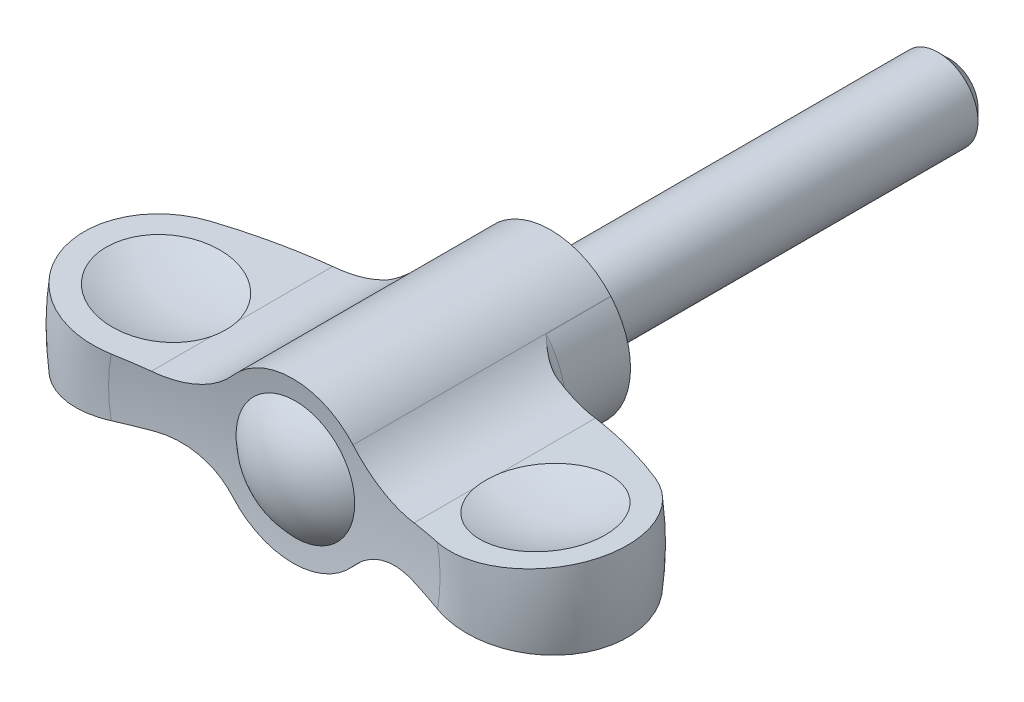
ISO-10303-21;
HEADER;
FILE_DESCRIPTION(('STEP AP214'),'2;1');
FILE_NAME('part.step','',(''),(''),'','','');
FILE_SCHEMA(('AUTOMOTIVE_DESIGN { 1 0 10303 214 1 1 1 1 }'));
ENDSEC;
DATA;
#1=APPLICATION_CONTEXT('core data for automotive mechanical design processes');
#2=APPLICATION_PROTOCOL_DEFINITION('international standard','automotive_design',2000,#1);
#3=PRODUCT_CONTEXT('',#1,'mechanical');
#4=PRODUCT('Part','Part','',(#3));
#5=PRODUCT_RELATED_PRODUCT_CATEGORY('part','',(#4));
#6=PRODUCT_DEFINITION_FORMATION('','',#4);
#7=PRODUCT_DEFINITION_CONTEXT('part definition',#1,'design');
#8=PRODUCT_DEFINITION('design','',#6,#7);
#9=PRODUCT_DEFINITION_SHAPE('','',#8);
#10=(LENGTH_UNIT() NAMED_UNIT(*) SI_UNIT(.MILLI.,.METRE.));
#11=(NAMED_UNIT(*) PLANE_ANGLE_UNIT() SI_UNIT($,.RADIAN.));
#12=(NAMED_UNIT(*) SI_UNIT($,.STERADIAN.) SOLID_ANGLE_UNIT());
#13=UNCERTAINTY_MEASURE_WITH_UNIT(LENGTH_MEASURE(1.E-05),#10,'distance_accuracy_value','');
#14=(GEOMETRIC_REPRESENTATION_CONTEXT(3) GLOBAL_UNCERTAINTY_ASSIGNED_CONTEXT((#13)) GLOBAL_UNIT_ASSIGNED_CONTEXT((#10,
#11,#12)) REPRESENTATION_CONTEXT('',''));
#15=CARTESIAN_POINT('',(0.,0.,0.));
#16=DIRECTION('',(0.,0.,1.));
#17=DIRECTION('',(1.,0.,0.));
#18=AXIS2_PLACEMENT_3D('',#15,#16,#17);
#19=CARTESIAN_POINT('',(0.,0.,6.5));
#20=DIRECTION('',(0.,0.,1.));
#21=DIRECTION('',(0.,-1.,0.));
#22=AXIS2_PLACEMENT_3D('',#19,#20,#21);
#23=TOROIDAL_SURFACE('',#22,9.4,1.40000000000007);
#24=DIRECTION('',(0.,0.,1.));
#25=VECTOR('',#24,1.);
#26=CARTESIAN_POINT('',(6.03890778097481,-5.2470556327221,-40.));
#27=LINE('',#26,#25);
#28=CARTESIAN_POINT('',(6.03890778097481,-5.24705563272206,6.5));
#29=VERTEX_POINT('',#28);
#30=CARTESIAN_POINT('',(6.03890778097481,-5.2470556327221,6.5021200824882));
#31=VERTEX_POINT('',#30);
#32=EDGE_CURVE('E178',#29,#31,#27,.T.);
#33=ORIENTED_EDGE('',*,*,#32,.F.);
#34=CARTESIAN_POINT('',(0.,0.,6.5));
#35=DIRECTION('',(0.,0.,1.));
#36=DIRECTION('',(0.,-1.,0.));
#37=AXIS2_PLACEMENT_3D('',#34,#35,#36);
#38=CIRCLE('',#37,8.);
#39=CARTESIAN_POINT('',(6.0470062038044,5.23772049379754,6.4999999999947));
#40=VERTEX_POINT('',#39);
#41=EDGE_CURVE('E299',#29,#40,#38,.T.);
#42=ORIENTED_EDGE('',*,*,#41,.T.);
#43=CARTESIAN_POINT('',(8.59708199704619,3.29504177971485,7.88661989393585));
#44=CARTESIAN_POINT('',(8.50944178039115,3.33729136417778,7.87729621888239));
#45=CARTESIAN_POINT('',(8.42307614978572,3.38091432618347,7.86348310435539));
#46=CARTESIAN_POINT('',(8.25334791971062,3.47048341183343,7.82827393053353));
#47=CARTESIAN_POINT('',(8.16997966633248,3.51642472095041,7.80689307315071));
#48=CARTESIAN_POINT('',(8.006927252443,3.6100455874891,7.75806975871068));
#49=CARTESIAN_POINT('',(7.92722117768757,3.65771052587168,7.73067131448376));
#50=CARTESIAN_POINT('',(7.77086822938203,3.75487699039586,7.67078020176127));
#51=CARTESIAN_POINT('',(7.69422278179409,3.80437935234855,7.6382851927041));
#52=CARTESIAN_POINT('',(7.51481068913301,3.9245724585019,7.55570149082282));
#53=CARTESIAN_POINT('',(7.41345025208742,3.996030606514,7.50367899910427));
#54=CARTESIAN_POINT('',(7.21620642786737,4.14190058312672,7.39355525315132));
#55=CARTESIAN_POINT('',(7.12032815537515,4.21631506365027,7.33544846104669));
#56=CARTESIAN_POINT('',(6.89765495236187,4.39723051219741,7.19147911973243));
#57=CARTESIAN_POINT('',(6.77323076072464,4.50501816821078,7.10356810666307));
#58=CARTESIAN_POINT('',(6.57394920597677,4.68848676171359,6.95337103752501));
#59=CARTESIAN_POINT('',(6.49659267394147,4.7626588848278,6.89250585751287));
#60=CARTESIAN_POINT('',(6.37240043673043,4.8865809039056,6.79132557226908));
#61=CARTESIAN_POINT('',(6.32451434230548,4.93561192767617,6.75141880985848));
#62=CARTESIAN_POINT('',(6.24744938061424,5.01656740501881,6.68590586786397));
#63=CARTESIAN_POINT('',(6.21784284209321,5.04817964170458,6.66041557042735));
#64=CARTESIAN_POINT('',(6.1701203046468,5.09997024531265,6.61881307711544));
#65=CARTESIAN_POINT('',(6.15183084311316,5.12002285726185,6.60274326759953));
#66=CARTESIAN_POINT('',(6.12231217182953,5.15271930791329,6.57655539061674));
#67=CARTESIAN_POINT('',(6.11100884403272,5.16531979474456,6.56646663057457));
#68=CARTESIAN_POINT('',(6.09275021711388,5.18580384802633,6.549990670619));
#69=CARTESIAN_POINT('',(6.08575717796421,5.19368060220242,6.54363714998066));
#70=CARTESIAN_POINT('',(6.07446460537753,5.20645064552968,6.53319636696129));
#71=CARTESIAN_POINT('',(6.07013806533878,5.21135545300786,6.52915239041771));
#72=CARTESIAN_POINT('',(6.06316395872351,5.21928103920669,6.52242537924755));
#73=CARTESIAN_POINT('',(6.06049083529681,5.22232358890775,6.51979601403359));
#74=CARTESIAN_POINT('',(6.05620285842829,5.22721145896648,6.51533355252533));
#75=CARTESIAN_POINT('',(6.05455913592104,5.22908696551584,6.51356171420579));
#76=CARTESIAN_POINT('',(6.05194270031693,5.23207504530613,6.51046552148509));
#77=CARTESIAN_POINT('',(6.05093886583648,5.23322217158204,6.50920550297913));
#78=CARTESIAN_POINT('',(6.04952852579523,5.23483466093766,6.50714224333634));
#79=CARTESIAN_POINT('',(6.04907130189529,5.23535757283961,6.50641962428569));
#80=CARTESIAN_POINT('',(6.04823146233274,5.23631829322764,6.50488003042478));
#81=CARTESIAN_POINT('',(6.04784824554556,5.23675678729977,6.50406390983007));
#82=CARTESIAN_POINT('',(6.04743475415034,5.2372299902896,6.50282878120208));
#83=CARTESIAN_POINT('',(6.04733123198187,5.23734847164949,6.50246832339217));
#84=CARTESIAN_POINT('',(6.04716301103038,5.23754100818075,6.50172769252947));
#85=CARTESIAN_POINT('',(6.04709815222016,5.23761524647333,6.50134760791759));
#86=CARTESIAN_POINT('',(6.04703697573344,5.23768527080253,6.50077037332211));
#87=CARTESIAN_POINT('',(6.04702259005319,5.23770173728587,6.50057747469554));
#88=CARTESIAN_POINT('',(6.0470060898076,5.23772062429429,6.50018965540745));
#89=CARTESIAN_POINT('',(6.04700402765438,5.23772298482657,6.49999472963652));
#90=CARTESIAN_POINT('',(6.0470084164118,5.23771796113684,6.49979999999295));
#91=B_SPLINE_CURVE_WITH_KNOTS('',3,(#43,#44,#45,#46,#47,#48,#49,#50,#51,#52,#53,#54,#55,#56,#57,
#58,#59,#60,#61,#62,#63,#64,#65,#66,#67,#68,#69,#70,#71,#72,#73,#74,#75,#76,#77,#78,#79,#80,#81,
#82,#83,#84,#85,#86,#87,#88,#89,#90),.UNSPECIFIED.,.F.,.F.,(4,2,2,2,2,2,2,2,2,2,2,2,2,2,2,2,2,2,
2,2,2,2,2,4),(0.,0.292919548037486,0.585253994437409,0.875517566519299,1.16591483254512,
1.56900991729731,1.97247513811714,2.53185645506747,2.90152662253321,3.1394263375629,
3.29018867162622,3.38481100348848,3.44392835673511,3.48083041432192,3.50389909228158,
3.51838177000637,3.52755772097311,3.53347737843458,3.53648190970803,3.53946090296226,
3.54063718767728,3.54180856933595,3.54239014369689,3.5429741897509),.UNSPECIFIED.);
#92=CARTESIAN_POINT('',(8.59520200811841,3.29594858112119,7.88641989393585));
#93=VERTEX_POINT('',#92);
#94=EDGE_CURVE('E445',#93,#40,#91,.T.);
#95=ORIENTED_EDGE('',*,*,#94,.F.);
#96=CARTESIAN_POINT('',(0.,0.,7.88641989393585));
#97=DIRECTION('',(0.,0.,1.));
#98=DIRECTION('',(0.,-1.,0.));
#99=AXIS2_PLACEMENT_3D('',#96,#97,#98);
#100=CIRCLE('',#99,9.20547525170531);
#101=CARTESIAN_POINT('',(8.59545916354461,-3.29527789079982,7.88641989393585));
#102=VERTEX_POINT('',#101);
#103=EDGE_CURVE('E300',#102,#93,#100,.T.);
#104=ORIENTED_EDGE('',*,*,#103,.F.);
#105=CARTESIAN_POINT('',(9.2464198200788,-3.01597169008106,7.86154869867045));
#106=CARTESIAN_POINT('',(9.191703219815,-3.03662617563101,7.87246212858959));
#107=CARTESIAN_POINT('',(9.13683292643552,-3.05803382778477,7.88088984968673));
#108=CARTESIAN_POINT('',(9.0272184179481,-3.10220967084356,7.89317258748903));
#109=CARTESIAN_POINT('',(8.97247413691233,-3.12497578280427,7.89703441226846));
#110=CARTESIAN_POINT('',(8.80995844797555,-3.19470660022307,7.90236716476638));
#111=CARTESIAN_POINT('',(8.70276195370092,-3.24353448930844,7.89779252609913));
#112=CARTESIAN_POINT('',(8.51047394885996,-3.33625869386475,7.87741400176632));
#113=CARTESIAN_POINT('',(8.42481297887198,-3.37951008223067,7.86372857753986));
#114=CARTESIAN_POINT('',(8.25627111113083,-3.46839491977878,7.82888132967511));
#115=CARTESIAN_POINT('',(8.17339149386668,-3.51402944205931,7.80771611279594));
#116=CARTESIAN_POINT('',(7.92832133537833,-3.65460006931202,7.73466741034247));
#117=CARTESIAN_POINT('',(7.77073045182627,-3.75270198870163,7.67337075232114));
#118=CARTESIAN_POINT('',(7.51219223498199,-3.92592329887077,7.55434149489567));
#119=CARTESIAN_POINT('',(7.40810830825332,-3.99942155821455,7.50076399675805));
#120=CARTESIAN_POINT('',(7.20573498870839,-4.14951628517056,7.38724676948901));
#121=CARTESIAN_POINT('',(7.10744753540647,-4.22611377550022,7.32730492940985));
#122=CARTESIAN_POINT('',(6.91648045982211,-4.38209339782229,7.20294133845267));
#123=CARTESIAN_POINT('',(6.82379096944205,-4.46147021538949,7.13852792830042));
#124=CARTESIAN_POINT('',(6.64338510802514,-4.62314447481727,7.00654560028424));
#125=CARTESIAN_POINT('',(6.55566785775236,-4.70544139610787,6.93897724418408));
#126=CARTESIAN_POINT('',(6.43300905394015,-4.82577735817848,6.84059313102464));
#127=CARTESIAN_POINT('',(6.39621820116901,-4.86258512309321,6.8105538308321));
#128=CARTESIAN_POINT('',(6.32347498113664,-4.93679114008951,6.75019039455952));
#129=CARTESIAN_POINT('',(6.28752259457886,-4.97418937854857,6.71986626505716));
#130=CARTESIAN_POINT('',(6.23420044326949,-5.03074553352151,6.67427938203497));
#131=CARTESIAN_POINT('',(6.21653276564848,-5.04966820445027,6.65907163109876));
#132=CARTESIAN_POINT('',(6.18141428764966,-5.08764734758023,6.62856921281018));
#133=CARTESIAN_POINT('',(6.16396349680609,-5.10670382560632,6.61327454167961));
#134=CARTESIAN_POINT('',(6.12918837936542,-5.14505447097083,6.58285648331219));
#135=CARTESIAN_POINT('',(6.11186402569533,-5.16434858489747,6.5677330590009));
#136=CARTESIAN_POINT('',(6.07769243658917,-5.20276831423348,6.53674407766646));
#137=CARTESIAN_POINT('',(6.06084502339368,-5.22189399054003,6.52087880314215));
#138=CARTESIAN_POINT('',(6.04125233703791,-5.24436286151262,6.50407138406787));
#139=CARTESIAN_POINT('',(6.03883132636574,-5.24714312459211,6.5020224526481));
#140=CARTESIAN_POINT('',(6.036402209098,-5.24993655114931,6.5));
#141=B_SPLINE_CURVE_WITH_KNOTS('',3,(#105,#106,#107,#108,#109,#110,#111,#112,#113,#114,#115,
#116,#117,#118,#119,#120,#121,#122,#123,#124,#125,#126,#127,#128,#129,#130,#131,#132,#133,#134,
#135,#136,#137,#138,#139,#140),.UNSPECIFIED.,.F.,.F.,(4,2,2,2,2,2,2,2,2,2,2,2,2,2,2,2,2,4),(0.,
0.178341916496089,0.356417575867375,0.708892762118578,0.999321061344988,1.28988128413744,
1.87442815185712,2.28884312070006,2.7033959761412,3.11719533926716,3.53092130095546,
3.71118323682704,3.89144102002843,3.98151493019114,4.07159278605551,4.16165075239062,
4.25167469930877,4.26432797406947),.UNSPECIFIED.);
#142=EDGE_CURVE('E316',#31,#102,#141,.F.);
#143=ORIENTED_EDGE('',*,*,#142,.F.);
#144=EDGE_LOOP('',(#33,#42,#95,#104,#143));
#145=FACE_BOUND('',#144,.T.);
#146=ADVANCED_FACE('F14',(#145),#23,.F.);
#147=CARTESIAN_POINT('',(7.9999999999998,0.,0.));
#148=DIRECTION('',(0.,0.,-1.));
#149=DIRECTION('',(0.,1.,0.));
#150=AXIS2_PLACEMENT_3D('',#147,#148,#149);
#151=PLANE('',#150);
#152=CARTESIAN_POINT('',(0.,0.,0.));
#153=DIRECTION('',(0.,0.,1.));
#154=DIRECTION('',(0.,-1.,0.));
#155=AXIS2_PLACEMENT_3D('',#152,#153,#154);
#156=CIRCLE('',#155,4.);
#157=CARTESIAN_POINT('',(0.,-4.,0.));
#158=VERTEX_POINT('',#157);
#159=EDGE_CURVE('E475',#158,#158,#156,.T.);
#160=ORIENTED_EDGE('',*,*,#159,.T.);
#161=EDGE_LOOP('',(#160));
#162=FACE_BOUND('',#161,.T.);
#163=CARTESIAN_POINT('',(12.0717114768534,10.5010774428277,0.));
#164=DIRECTION('',(0.,0.,-1.));
#165=DIRECTION('',(0.,1.,0.));
#166=AXIS2_PLACEMENT_3D('',#163,#164,#165);
#167=CIRCLE('',#166,8.);
#168=CARTESIAN_POINT('',(6.0470062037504,5.23772049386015,0.));
#169=VERTEX_POINT('',#168);
#170=CARTESIAN_POINT('',(6.02470527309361,5.26335694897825,0.));
#171=VERTEX_POINT('',#170);
#172=EDGE_CURVE('E454',#169,#171,#167,.T.);
#173=ORIENTED_EDGE('',*,*,#172,.F.);
#174=CARTESIAN_POINT('',(0.,0.,0.));
#175=DIRECTION('',(0.,0.,1.));
#176=DIRECTION('',(0.,-1.,0.));
#177=AXIS2_PLACEMENT_3D('',#174,#175,#176);
#178=CIRCLE('',#177,8.);
#179=CARTESIAN_POINT('',(-6.04700620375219,5.23772049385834,0.));
#180=VERTEX_POINT('',#179);
#181=EDGE_CURVE('E472',#180,#169,#178,.T.);
#182=ORIENTED_EDGE('',*,*,#181,.F.);
#183=CARTESIAN_POINT('',(-12.0717114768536,10.5010774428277,0.));
#184=DIRECTION('',(0.,0.,-1.));
#185=DIRECTION('',(0.,1.,0.));
#186=AXIS2_PLACEMENT_3D('',#183,#184,#185);
#187=CIRCLE('',#186,8.);
#188=CARTESIAN_POINT('',(-6.0247052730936,5.26335694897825,0.));
#189=VERTEX_POINT('',#188);
#190=EDGE_CURVE('E521',#180,#189,#187,.F.);
#191=ORIENTED_EDGE('',*,*,#190,.T.);
#192=EDGE_CURVE('E471',#171,#189,#178,.T.);
#193=ORIENTED_EDGE('',*,*,#192,.F.);
#194=EDGE_LOOP('',(#173,#182,#191,#193));
#195=FACE_BOUND('',#194,.T.);
#196=ADVANCED_FACE('F268',(#162,#195),#151,.T.);
#197=CARTESIAN_POINT('',(0.,0.,32.9780362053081));
#198=DIRECTION('',(0.,0.,1.));
#199=DIRECTION('',(0.,-1.,0.));
#200=AXIS2_PLACEMENT_3D('',#197,#198,#199);
#201=CYLINDRICAL_SURFACE('',#200,8.);
#202=DIRECTION('',(0.,0.,1.));
#203=VECTOR('',#202,1.);
#204=CARTESIAN_POINT('',(-6.0247052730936,5.26335694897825,-40.));
#205=LINE('',#204,#203);
#206=CARTESIAN_POINT('',(-6.0247052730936,5.26335694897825,25.8131362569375));
#207=VERTEX_POINT('',#206);
#208=EDGE_CURVE('E162',#189,#207,#205,.T.);
#209=ORIENTED_EDGE('',*,*,#208,.T.);
#210=CARTESIAN_POINT('',(0.,0.,25.8131362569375));
#211=DIRECTION('',(0.,0.,1.));
#212=DIRECTION('',(0.,-1.,0.));
#213=AXIS2_PLACEMENT_3D('',#210,#211,#212);
#214=CIRCLE('',#213,8.);
#215=CARTESIAN_POINT('',(6.02470527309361,5.26335694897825,25.8131362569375));
#216=VERTEX_POINT('',#215);
#217=EDGE_CURVE('E477',#216,#207,#214,.T.);
#218=ORIENTED_EDGE('',*,*,#217,.F.);
#219=DIRECTION('',(0.,0.,1.));
#220=VECTOR('',#219,1.);
#221=CARTESIAN_POINT('',(6.02470527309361,5.26335694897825,-40.));
#222=LINE('',#221,#220);
#223=EDGE_CURVE('E165',#171,#216,#222,.T.);
#224=ORIENTED_EDGE('',*,*,#223,.F.);
#225=ORIENTED_EDGE('',*,*,#192,.T.);
#226=EDGE_LOOP('',(#209,#218,#224,#225));
#227=FACE_BOUND('',#226,.T.);
#228=ADVANCED_FACE('F275',(#227),#201,.T.);
#229=DIRECTION('',(0.,0.,1.));
#230=VECTOR('',#229,1.);
#231=CARTESIAN_POINT('',(-6.04700620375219,5.23772049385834,3.25));
#232=LINE('',#231,#230);
#233=CARTESIAN_POINT('',(-6.04700620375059,5.23772049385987,6.5));
#234=VERTEX_POINT('',#233);
#235=EDGE_CURVE('E523',#180,#234,#232,.T.);
#236=ORIENTED_EDGE('',*,*,#235,.F.);
#237=ORIENTED_EDGE('',*,*,#181,.T.);
#238=DIRECTION('',(0.,0.,1.));
#239=VECTOR('',#238,1.);
#240=CARTESIAN_POINT('',(6.0470062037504,5.23772049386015,3.25));
#241=LINE('',#240,#239);
#242=EDGE_CURVE('E451',#169,#40,#241,.T.);
#243=ORIENTED_EDGE('',*,*,#242,.T.);
#244=ORIENTED_EDGE('',*,*,#41,.F.);
#245=ORIENTED_EDGE('',*,*,#32,.T.);
#246=CARTESIAN_POINT('',(6.03890778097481,-5.2470556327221,25.8131362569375));
#247=VERTEX_POINT('',#246);
#248=EDGE_CURVE('E175',#31,#247,#27,.T.);
#249=ORIENTED_EDGE('',*,*,#248,.T.);
#250=CARTESIAN_POINT('',(0.,0.,25.8131362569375));
#251=DIRECTION('',(0.,0.,1.));
#252=DIRECTION('',(0.,-1.,0.));
#253=AXIS2_PLACEMENT_3D('',#250,#251,#252);
#254=CIRCLE('',#253,8.);
#255=CARTESIAN_POINT('',(-6.0389077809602,-5.24705563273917,25.8131362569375));
#256=VERTEX_POINT('',#255);
#257=EDGE_CURVE('E304',#256,#247,#254,.T.);
#258=ORIENTED_EDGE('',*,*,#257,.F.);
#259=DIRECTION('',(0.,0.,1.));
#260=VECTOR('',#259,1.);
#261=CARTESIAN_POINT('',(-6.03890778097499,-5.2470556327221,-40.));
#262=LINE('',#261,#260);
#263=CARTESIAN_POINT('',(-6.03890778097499,-5.2470556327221,6.5021200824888));
#264=VERTEX_POINT('',#263);
#265=EDGE_CURVE('E171',#264,#256,#262,.T.);
#266=ORIENTED_EDGE('',*,*,#265,.F.);
#267=CARTESIAN_POINT('',(-6.03890778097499,-5.24705563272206,6.5));
#268=VERTEX_POINT('',#267);
#269=EDGE_CURVE('E174',#268,#264,#262,.T.);
#270=ORIENTED_EDGE('',*,*,#269,.F.);
#271=EDGE_CURVE('E294',#234,#268,#38,.T.);
#272=ORIENTED_EDGE('',*,*,#271,.F.);
#273=EDGE_LOOP('',(#236,#237,#243,#244,#245,#249,#258,#266,#270,#272));
#274=FACE_BOUND('',#273,.T.);
#275=ADVANCED_FACE('F282',(#274),#201,.T.);
#276=ORIENTED_EDGE('',*,*,#271,.T.);
#277=ORIENTED_EDGE('',*,*,#269,.T.);
#278=CARTESIAN_POINT('',(-9.246419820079,-3.01597169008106,7.86154869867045));
#279=CARTESIAN_POINT('',(-9.19170321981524,-3.03662617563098,7.87246212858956));
#280=CARTESIAN_POINT('',(-9.1368329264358,-3.05803382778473,7.88088984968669));
#281=CARTESIAN_POINT('',(-9.02721841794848,-3.10220967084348,7.89317258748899));
#282=CARTESIAN_POINT('',(-8.97247413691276,-3.12497578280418,7.89703441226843));
#283=CARTESIAN_POINT('',(-8.80995844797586,-3.19470660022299,7.9023671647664));
#284=CARTESIAN_POINT('',(-8.70276195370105,-3.24353448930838,7.89779252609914));
#285=CARTESIAN_POINT('',(-8.51047394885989,-3.33625869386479,7.87741400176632));
#286=CARTESIAN_POINT('',(-8.42481297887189,-3.37951008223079,7.86372857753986));
#287=CARTESIAN_POINT('',(-8.25627111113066,-3.46839491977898,7.82888132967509));
#288=CARTESIAN_POINT('',(-8.17339149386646,-3.51402944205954,7.80771611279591));
#289=CARTESIAN_POINT('',(-7.92832133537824,-3.65460006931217,7.73466741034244));
#290=CARTESIAN_POINT('',(-7.77073045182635,-3.75270198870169,7.67337075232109));
#291=CARTESIAN_POINT('',(-7.51219223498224,-3.92592329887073,7.55434149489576));
#292=CARTESIAN_POINT('',(-7.40810830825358,-3.99942155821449,7.50076399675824));
#293=CARTESIAN_POINT('',(-7.20573498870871,-4.14951628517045,7.38724676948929));
#294=CARTESIAN_POINT('',(-7.10744753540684,-4.22611377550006,7.32730492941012));
#295=CARTESIAN_POINT('',(-6.91648045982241,-4.38209339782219,7.20294133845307));
#296=CARTESIAN_POINT('',(-6.82379096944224,-4.46147021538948,7.13852792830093));
#297=CARTESIAN_POINT('',(-6.64338510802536,-4.62314447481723,7.00654560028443));
#298=CARTESIAN_POINT('',(-6.5556678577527,-4.7054413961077,6.93897724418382));
#299=CARTESIAN_POINT('',(-6.43300905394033,-4.82577735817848,6.84059313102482));
#300=CARTESIAN_POINT('',(-6.39621820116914,-4.86258512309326,6.81055383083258));
#301=CARTESIAN_POINT('',(-6.3234749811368,-4.93679114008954,6.75019039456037));
#302=CARTESIAN_POINT('',(-6.28752259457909,-4.97418937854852,6.71986626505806));
#303=CARTESIAN_POINT('',(-6.23420044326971,-5.03074553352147,6.6742793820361));
#304=CARTESIAN_POINT('',(-6.21653276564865,-5.04966820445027,6.65907163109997));
#305=CARTESIAN_POINT('',(-6.18141428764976,-5.08764734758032,6.62856921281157));
#306=CARTESIAN_POINT('',(-6.16396349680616,-5.10670382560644,6.61327454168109));
#307=CARTESIAN_POINT('',(-6.12918837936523,-5.14505447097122,6.58285648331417));
#308=CARTESIAN_POINT('',(-6.11186402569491,-5.1643485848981,6.56773305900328));
#309=CARTESIAN_POINT('',(-6.07769243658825,-5.20276831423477,6.53674407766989));
#310=CARTESIAN_POINT('',(-6.06084502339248,-5.22189399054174,6.52087880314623));
#311=CARTESIAN_POINT('',(-6.04125233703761,-5.24436286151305,6.50407138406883));
#312=CARTESIAN_POINT('',(-6.03883132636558,-5.24714312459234,6.50202245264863));
#313=CARTESIAN_POINT('',(-6.036402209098,-5.2499365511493,6.5));
#314=B_SPLINE_CURVE_WITH_KNOTS('',3,(#278,#279,#280,#281,#282,#283,#284,#285,#286,#287,#288,
#289,#290,#291,#292,#293,#294,#295,#296,#297,#298,#299,#300,#301,#302,#303,#304,#305,#306,#307,
#308,#309,#310,#311,#312,#313),.UNSPECIFIED.,.F.,.F.,(4,2,2,2,2,2,2,2,2,2,2,2,2,2,2,2,2,4),(0.,
0.178341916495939,0.356417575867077,0.708892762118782,0.999321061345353,1.28988128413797,
1.8744281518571,2.28884312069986,2.70339597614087,3.11719533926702,3.53092130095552,
3.71118323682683,3.89144102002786,3.98151493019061,4.07159278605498,4.16165075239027,
4.25167469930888,4.2643279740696),.UNSPECIFIED.);
#315=CARTESIAN_POINT('',(-8.59545916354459,-3.29527789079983,7.88641989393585));
#316=VERTEX_POINT('',#315);
#317=EDGE_CURVE('E311',#264,#316,#314,.F.);
#318=ORIENTED_EDGE('',*,*,#317,.T.);
#319=CARTESIAN_POINT('',(-8.5952020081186,3.29594858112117,7.88641989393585));
#320=VERTEX_POINT('',#319);
#321=EDGE_CURVE('E467',#320,#316,#100,.T.);
#322=ORIENTED_EDGE('',*,*,#321,.F.);
#323=CARTESIAN_POINT('',(-8.59708199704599,3.29504177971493,7.88661989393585));
#324=CARTESIAN_POINT('',(-8.50944178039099,3.33729136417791,7.87729621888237));
#325=CARTESIAN_POINT('',(-8.42307614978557,3.38091432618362,7.86348310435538));
#326=CARTESIAN_POINT('',(-8.25334791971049,3.47048341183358,7.82827393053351));
#327=CARTESIAN_POINT('',(-8.16997966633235,3.51642472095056,7.80689307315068));
#328=CARTESIAN_POINT('',(-8.00692725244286,3.61004558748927,7.75806975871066));
#329=CARTESIAN_POINT('',(-7.92722117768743,3.65771052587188,7.73067131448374));
#330=CARTESIAN_POINT('',(-7.77086822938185,3.75487699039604,7.67078020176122));
#331=CARTESIAN_POINT('',(-7.69422278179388,3.80437935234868,7.63828519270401));
#332=CARTESIAN_POINT('',(-7.51481068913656,3.92457245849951,7.55570149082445));
#333=CARTESIAN_POINT('',(-7.41345025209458,3.99603060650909,7.50367899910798));
#334=CARTESIAN_POINT('',(-7.21620642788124,4.14190058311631,7.39355525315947));
#335=CARTESIAN_POINT('',(-7.12032815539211,4.2163150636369,7.33544846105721));
#336=CARTESIAN_POINT('',(-6.8976549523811,4.39723051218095,7.19147911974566));
#337=CARTESIAN_POINT('',(-6.77323076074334,4.50501816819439,7.1035681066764));
#338=CARTESIAN_POINT('',(-6.57394920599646,4.68848676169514,6.95337103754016));
#339=CARTESIAN_POINT('',(-6.49659267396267,4.76265888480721,6.89250585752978));
#340=CARTESIAN_POINT('',(-6.37240043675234,4.88658090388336,6.7913255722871));
#341=CARTESIAN_POINT('',(-6.32451434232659,4.93561192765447,6.7514188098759));
#342=CARTESIAN_POINT('',(-6.24744938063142,5.01656740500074,6.68590586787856));
#343=CARTESIAN_POINT('',(-6.21784284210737,5.04817964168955,6.66041557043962));
#344=CARTESIAN_POINT('',(-6.17012030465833,5.09997024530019,6.61881307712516));
#345=CARTESIAN_POINT('',(-6.1518308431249,5.12002285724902,6.60274326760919));
#346=CARTESIAN_POINT('',(-6.12231217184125,5.15271930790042,6.57655539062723));
#347=CARTESIAN_POINT('',(-6.11100884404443,5.16531979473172,6.56646663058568));
#348=CARTESIAN_POINT('',(-6.09275021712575,5.1858038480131,6.54999067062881));
#349=CARTESIAN_POINT('',(-6.08575717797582,5.19368060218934,6.54363714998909));
#350=CARTESIAN_POINT('',(-6.07446460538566,5.20645064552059,6.53319636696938));
#351=CARTESIAN_POINT('',(-6.07013806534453,5.21135545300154,6.52915239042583));
#352=CARTESIAN_POINT('',(-6.06316395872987,5.21928103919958,6.52242537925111));
#353=CARTESIAN_POINT('',(-6.06049083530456,5.22232358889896,6.51979601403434));
#354=CARTESIAN_POINT('',(-6.05620285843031,5.22721145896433,6.51533355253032));
#355=CARTESIAN_POINT('',(-6.05455913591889,5.22908696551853,6.51356171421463));
#356=CARTESIAN_POINT('',(-6.05194270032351,5.23207504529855,6.51046552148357));
#357=CARTESIAN_POINT('',(-6.05093886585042,5.23322217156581,6.50920550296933));
#358=CARTESIAN_POINT('',(-6.04952852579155,5.23483466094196,6.5071422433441));
#359=CARTESIAN_POINT('',(-6.0490713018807,5.23535757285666,6.50641962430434));
#360=CARTESIAN_POINT('',(-6.04823146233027,5.23631829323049,6.50488003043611));
#361=CARTESIAN_POINT('',(-6.04784824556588,5.23675678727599,6.50406390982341));
#362=CARTESIAN_POINT('',(-6.04743475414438,5.23722999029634,6.50282878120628));
#363=CARTESIAN_POINT('',(-6.04733123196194,5.23734847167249,6.50246832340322));
#364=CARTESIAN_POINT('',(-6.04716301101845,5.23754100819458,6.50172769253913));
#365=CARTESIAN_POINT('',(-6.04709815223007,5.23761524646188,6.50134760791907));
#366=CARTESIAN_POINT('',(-6.04703697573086,5.23768527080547,6.5007703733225));
#367=CARTESIAN_POINT('',(-6.04702259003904,5.23770173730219,6.50057747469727));
#368=CARTESIAN_POINT('',(-6.04700608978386,5.23772062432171,6.50018965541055));
#369=CARTESIAN_POINT('',(-6.04700402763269,5.23772298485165,6.49999472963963));
#370=CARTESIAN_POINT('',(-6.0470084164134,5.23771796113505,6.49979999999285));
#371=B_SPLINE_CURVE_WITH_KNOTS('',3,(#323,#324,#325,#326,#327,#328,#329,#330,#331,#332,#333,
#334,#335,#336,#337,#338,#339,#340,#341,#342,#343,#344,#345,#346,#347,#348,#349,#350,#351,#352,
#353,#354,#355,#356,#357,#358,#359,#360,#361,#362,#363,#364,#365,#366,#367,#368,#369,#370),
.UNSPECIFIED.,.F.,.F.,(4,2,2,2,2,2,2,2,2,2,2,2,2,2,2,2,2,2,2,2,2,2,2,4),(0.,0.292919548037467,
0.58525399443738,0.875517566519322,1.16591483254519,1.56900991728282,1.97247513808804,
2.53185645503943,2.90152662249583,3.13942633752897,3.29018867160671,3.38481100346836,
3.44392835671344,3.48083041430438,3.503899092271,3.51838176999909,3.52755772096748,
3.53347737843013,3.53648190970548,3.53946090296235,3.54063718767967,3.54180856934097,
3.54239014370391,3.54297418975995),.UNSPECIFIED.);
#372=EDGE_CURVE('E194',#320,#234,#371,.T.);
#373=ORIENTED_EDGE('',*,*,#372,.T.);
#374=EDGE_LOOP('',(#276,#277,#318,#322,#373));
#375=FACE_BOUND('',#374,.T.);
#376=ADVANCED_FACE('F270',(#375),#23,.F.);
#377=CARTESIAN_POINT('',(0.,0.,55.408674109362));
#378=DIRECTION('',(0.,0.,1.));
#379=DIRECTION('',(0.,-1.,0.));
#380=AXIS2_PLACEMENT_3D('',#377,#378,#379);
#381=DEGENERATE_TOROIDAL_SURFACE('',#380,2.53775894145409,47.9877389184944,.T.);
#382=ORIENTED_EDGE('',*,*,#103,.T.);
#383=CARTESIAN_POINT('',(5.40789714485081,6.07461400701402,7.74825077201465));
#384=CARTESIAN_POINT('',(5.5291773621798,5.89198502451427,7.7417150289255));
#385=CARTESIAN_POINT('',(5.65803975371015,5.71432205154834,7.7372582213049));
#386=CARTESIAN_POINT('',(5.92992964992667,5.37014226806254,7.7324895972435));
#387=CARTESIAN_POINT('',(6.07295642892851,5.2036248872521,7.73217756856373));
#388=CARTESIAN_POINT('',(6.37210580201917,4.88302009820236,7.73568398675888));
#389=CARTESIAN_POINT('',(6.52822111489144,4.72892587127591,7.73950015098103));
#390=CARTESIAN_POINT('',(6.85248447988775,4.43414479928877,7.75130368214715));
#391=CARTESIAN_POINT('',(7.02063240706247,4.29345781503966,7.75929100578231));
#392=CARTESIAN_POINT('',(7.36839276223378,4.02596374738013,7.77954568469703));
#393=CARTESIAN_POINT('',(7.54804576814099,3.89921061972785,7.79182895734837));
#394=CARTESIAN_POINT('',(7.9169239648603,3.66105266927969,7.82074605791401));
#395=CARTESIAN_POINT('',(8.10614934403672,3.54964814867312,7.83737997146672));
#396=CARTESIAN_POINT('',(8.49266533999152,3.34297499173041,7.87504105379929));
#397=CARTESIAN_POINT('',(8.68995161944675,3.24769781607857,7.89606588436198));
#398=CARTESIAN_POINT('',(9.09122637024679,3.07379499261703,7.94252339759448));
#399=CARTESIAN_POINT('',(9.29521479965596,2.99516924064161,7.96795605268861));
#400=CARTESIAN_POINT('',(9.70845663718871,2.854990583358,8.02319155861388));
#401=CARTESIAN_POINT('',(9.91771139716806,2.79344211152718,8.05299554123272));
#402=CARTESIAN_POINT('',(10.3400150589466,2.68771529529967,8.11688005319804));
#403=CARTESIAN_POINT('',(10.5530655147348,2.64354424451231,8.15096237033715));
#404=CARTESIAN_POINT('',(10.9815499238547,2.57272696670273,8.22326754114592));
#405=CARTESIAN_POINT('',(11.1969857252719,2.54609545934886,8.2614938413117));
#406=CARTESIAN_POINT('',(11.6284903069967,2.51043256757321,8.34184151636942));
#407=CARTESIAN_POINT('',(11.844558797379,2.50139409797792,8.38396131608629));
#408=CARTESIAN_POINT('',(12.2806577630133,2.50077046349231,8.47281848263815));
#409=CARTESIAN_POINT('',(12.5006723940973,2.50956853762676,8.51963625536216));
#410=CARTESIAN_POINT('',(12.9384709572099,2.54513800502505,8.6167995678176));
#411=CARTESIAN_POINT('',(13.156254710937,2.57191082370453,8.66714538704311));
#412=CARTESIAN_POINT('',(13.5879515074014,2.6430363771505,8.77098851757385));
#413=CARTESIAN_POINT('',(13.8018678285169,2.68737341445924,8.82448297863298));
#414=CARTESIAN_POINT('',(14.2246542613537,2.79313397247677,8.93430204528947));
#415=CARTESIAN_POINT('',(14.4335251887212,2.85455471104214,8.99062618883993));
#416=CARTESIAN_POINT('',(14.6392212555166,2.92427775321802,9.04819298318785));
#417=B_SPLINE_CURVE_WITH_KNOTS('',3,(#383,#384,#385,#386,#387,#388,#389,#390,#391,#392,#393,
#394,#395,#396,#397,#398,#399,#400,#401,#402,#403,#404,#405,#406,#407,#408,#409,#410,#411,#412,
#413,#414,#415,#416),.UNSPECIFIED.,.F.,.F.,(4,2,2,2,2,2,2,2,2,2,2,2,2,2,2,2,4),(0.,
0.657784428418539,1.31553517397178,1.9729224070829,2.63030281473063,3.2901452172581,
3.95000060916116,4.60950551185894,5.26900628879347,5.92867812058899,6.58862653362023,
7.24912809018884,7.90936359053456,8.58393530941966,9.25856052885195,9.93258417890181,
10.6064981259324),.UNSPECIFIED.);
#418=CARTESIAN_POINT('',(13.1528156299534,2.57446317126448,8.66701618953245));
#419=VERTEX_POINT('',#418);
#420=EDGE_CURVE('E438',#93,#419,#417,.T.);
#421=ORIENTED_EDGE('',*,*,#420,.T.);
#422=CARTESIAN_POINT('',(13.1526156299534,2.57444288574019,8.66696966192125));
#423=CARTESIAN_POINT('',(13.9370340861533,2.65400458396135,8.84943351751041));
#424=CARTESIAN_POINT('',(14.7168563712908,2.73310010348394,9.05185397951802));
#425=CARTESIAN_POINT('',(16.2633623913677,2.88995853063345,9.49546553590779));
#426=CARTESIAN_POINT('',(17.0300745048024,2.96772431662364,9.73655668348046));
#427=CARTESIAN_POINT('',(18.5504261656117,3.12192996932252,10.2573018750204));
#428=CARTESIAN_POINT('',(19.3040656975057,3.19836983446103,10.5369559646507));
#429=CARTESIAN_POINT('',(20.7982632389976,3.34992273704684,11.134858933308));
#430=CARTESIAN_POINT('',(21.5387829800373,3.4250318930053,11.4532044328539));
#431=CARTESIAN_POINT('',(22.2708092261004,3.49927957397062,11.7901956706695));
#432=B_SPLINE_CURVE_WITH_KNOTS('',3,(#422,#423,#424,#425,#426,#427,#428,#429,#430,#431),
.UNSPECIFIED.,.F.,.F.,(4,2,2,2,4),(0.,2.42758220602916,4.84898838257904,7.27039742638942,
9.69798251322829),.UNSPECIFIED.);
#433=CARTESIAN_POINT('',(22.2703747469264,3.49923550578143,11.7899956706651));
#434=VERTEX_POINT('',#433);
#435=EDGE_CURVE('E431',#419,#434,#432,.T.);
#436=ORIENTED_EDGE('',*,*,#435,.T.);
#437=CARTESIAN_POINT('',(0.,0.,11.7899956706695));
#438=DIRECTION('',(0.,0.,1.));
#439=DIRECTION('',(0.,-1.,0.));
#440=AXIS2_PLACEMENT_3D('',#437,#438,#439);
#441=CIRCLE('',#440,22.5436075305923);
#442=CARTESIAN_POINT('',(22.2706216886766,-3.49766351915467,11.7899956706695));
#443=VERTEX_POINT('',#442);
#444=EDGE_CURVE('E464',#443,#434,#441,.T.);
#445=ORIENTED_EDGE('',*,*,#444,.F.);
#446=CARTESIAN_POINT('',(12.9962083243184,-2.55398166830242,8.63065853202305));
#447=CARTESIAN_POINT('',(13.7943446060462,-2.63519292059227,8.81347846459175));
#448=CARTESIAN_POINT('',(14.5877985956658,-2.71592774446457,9.01694513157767));
#449=CARTESIAN_POINT('',(16.1611919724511,-2.87602226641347,9.46398142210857));
#450=CARTESIAN_POINT('',(16.9411614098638,-2.95538502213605,9.70744418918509));
#451=CARTESIAN_POINT('',(18.4876557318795,-3.11274253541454,10.2342505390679));
#452=CARTESIAN_POINT('',(19.2541805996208,-3.19073729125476,10.5175941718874));
#453=CARTESIAN_POINT('',(20.7737763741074,-3.34535784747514,11.1241962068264));
#454=CARTESIAN_POINT('',(21.5268064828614,-3.42197949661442,11.4475578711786));
#455=CARTESIAN_POINT('',(22.271056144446,-3.4977077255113,11.7901956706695));
#456=B_SPLINE_CURVE_WITH_KNOTS('',3,(#446,#447,#448,#449,#450,#451,#452,#453,#454,#455),
.UNSPECIFIED.,.F.,.F.,(4,2,2,2,4),(0.,2.46819948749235,4.92990890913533,7.3916214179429,
9.85982400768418),.UNSPECIFIED.);
#457=CARTESIAN_POINT('',(12.9964083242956,-2.5540020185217,8.63070434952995));
#458=VERTEX_POINT('',#457);
#459=EDGE_CURVE('E414',#458,#443,#456,.T.);
#460=ORIENTED_EDGE('',*,*,#459,.F.);
#461=CARTESIAN_POINT('',(5.40816196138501,-6.0746786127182,7.7482771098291));
#462=CARTESIAN_POINT('',(5.52938177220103,-5.89205626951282,7.74173743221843));
#463=CARTESIAN_POINT('',(5.65818351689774,-5.7143974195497,7.73727619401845));
#464=CARTESIAN_POINT('',(5.92995209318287,-5.37022086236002,7.73249766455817));
#465=CARTESIAN_POINT('',(6.07291819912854,-5.20370258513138,7.7321801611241));
#466=CARTESIAN_POINT('',(6.37194671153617,-4.88309096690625,7.73567453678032));
#467=CARTESIAN_POINT('',(6.52800183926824,-4.72899081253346,7.73948413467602));
#468=CARTESIAN_POINT('',(6.85214571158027,-4.43419295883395,7.75127335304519));
#469=CARTESIAN_POINT('',(7.02023433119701,-4.29349512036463,7.75925293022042));
#470=CARTESIAN_POINT('',(7.36787685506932,-4.02597472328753,7.77949081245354));
#471=CARTESIAN_POINT('',(7.54747132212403,-3.89920607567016,7.79176502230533));
#472=CARTESIAN_POINT('',(7.91623418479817,-3.66101233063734,7.82066267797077));
#473=CARTESIAN_POINT('',(8.10540276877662,-3.54958753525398,7.83728620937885));
#474=CARTESIAN_POINT('',(8.49180737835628,-3.34286928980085,7.87492522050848));
#475=CARTESIAN_POINT('',(8.68903906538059,-3.24756730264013,7.89593836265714));
#476=CARTESIAN_POINT('',(9.09020720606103,-3.0736105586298,7.94237123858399));
#477=CARTESIAN_POINT('',(9.29414361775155,-2.99495569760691,7.96779094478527));
#478=CARTESIAN_POINT('',(9.70728411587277,-2.85471488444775,8.02299934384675));
#479=CARTESIAN_POINT('',(9.91648954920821,-2.79313334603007,8.05278916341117));
#480=CARTESIAN_POINT('',(10.3386977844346,-2.68733665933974,8.11664426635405));
#481=CARTESIAN_POINT('',(10.5517021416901,-2.6431288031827,8.15071133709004));
#482=CARTESIAN_POINT('',(10.980097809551,-2.57223450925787,8.22298504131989));
#483=CARTESIAN_POINT('',(11.1954909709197,-2.5455627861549,8.26119511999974));
#484=CARTESIAN_POINT('',(11.6269140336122,-2.50981645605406,8.34150952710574));
#485=CARTESIAN_POINT('',(11.8429436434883,-2.5007347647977,8.38361228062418));
#486=CARTESIAN_POINT('',(12.2789655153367,-2.50002106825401,8.4724337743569));
#487=CARTESIAN_POINT('',(12.4989420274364,-2.50877204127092,8.51923286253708));
#488=CARTESIAN_POINT('',(12.9366686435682,-2.5442445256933,8.61635812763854));
#489=CARTESIAN_POINT('',(13.1544185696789,-2.57096746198,8.66668458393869));
#490=CARTESIAN_POINT('',(13.5860522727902,-2.6419909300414,8.77048849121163));
#491=CARTESIAN_POINT('',(13.7999393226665,-2.68627577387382,8.82396309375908));
#492=CARTESIAN_POINT('',(14.2226717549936,-2.79192997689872,8.93374204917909));
#493=CARTESIAN_POINT('',(14.4315179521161,-2.85329655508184,8.99004594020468));
#494=CARTESIAN_POINT('',(14.6371915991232,-2.92296463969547,9.04759234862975));
#495=B_SPLINE_CURVE_WITH_KNOTS('',3,(#461,#462,#463,#464,#465,#466,#467,#468,#469,#470,#471,
#472,#473,#474,#475,#476,#477,#478,#479,#480,#481,#482,#483,#484,#485,#486,#487,#488,#489,#490,
#491,#492,#493,#494),.UNSPECIFIED.,.F.,.F.,(4,2,2,2,2,2,2,2,2,2,2,2,2,2,2,2,4),(0.,
0.657668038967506,1.31530240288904,1.97257345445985,2.62983768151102,3.28956225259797,
3.9492998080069,4.60868692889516,5.26806992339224,5.92762322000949,6.58745305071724,
7.24783584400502,7.90795261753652,8.58239553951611,9.25689194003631,9.93078716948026,
10.6045727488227),.UNSPECIFIED.);
#496=EDGE_CURVE('E314',#458,#102,#495,.F.);
#497=ORIENTED_EDGE('',*,*,#496,.T.);
#498=EDGE_LOOP('',(#382,#421,#436,#445,#460,#497));
#499=FACE_BOUND('',#498,.T.);
#500=ADVANCED_FACE('F281',(#499),#381,.T.);
#501=CARTESIAN_POINT('',(0.,0.,19.5161101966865));
#502=DIRECTION('',(0.,0.,1.));
#503=DIRECTION('',(0.,-1.,0.));
#504=AXIS2_PLACEMENT_3D('',#501,#502,#503);
#505=TOROIDAL_SURFACE('',#504,19.,8.5);
#506=CARTESIAN_POINT('',(0.,0.,27.6698599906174));
#507=DIRECTION('',(0.,0.,1.));
#508=DIRECTION('',(0.,-1.,0.));
#509=AXIS2_PLACEMENT_3D('',#506,#507,#508);
#510=CIRCLE('',#509,16.5986744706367);
#511=CARTESIAN_POINT('',(16.3443249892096,-2.89465625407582,27.6698599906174));
#512=VERTEX_POINT('',#511);
#513=CARTESIAN_POINT('',(16.3437132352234,2.89810832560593,27.6698599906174));
#514=VERTEX_POINT('',#513);
#515=EDGE_CURVE('E460',#512,#514,#510,.T.);
#516=ORIENTED_EDGE('',*,*,#515,.F.);
#517=CARTESIAN_POINT('',(22.2701871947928,-3.49761930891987,11.7897956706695));
#518=CARTESIAN_POINT('',(22.4865890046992,-3.51963843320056,11.8893708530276));
#519=CARTESIAN_POINT('',(22.6987916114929,-3.54123028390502,11.9981566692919));
#520=CARTESIAN_POINT('',(23.1133331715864,-3.5834103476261,12.2332797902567));
#521=CARTESIAN_POINT('',(23.3156725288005,-3.60399860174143,12.359616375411));
#522=CARTESIAN_POINT('',(23.7089103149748,-3.64401098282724,12.6288905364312));
#523=CARTESIAN_POINT('',(23.8998162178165,-3.66343587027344,12.771817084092));
#524=CARTESIAN_POINT('',(24.2689734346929,-3.70099802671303,13.0733193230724));
#525=CARTESIAN_POINT('',(24.4472249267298,-3.71913531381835,13.2318947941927));
#526=CARTESIAN_POINT('',(24.7898897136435,-3.75400183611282,13.5636589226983));
#527=CARTESIAN_POINT('',(24.9542960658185,-3.77073036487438,13.7368548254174));
#528=CARTESIAN_POINT('',(25.2679995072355,-3.80265003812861,14.0965647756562));
#529=CARTESIAN_POINT('',(25.4172963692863,-3.81784115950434,14.2830790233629));
#530=CARTESIAN_POINT('',(25.6996801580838,-3.84657402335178,14.6680564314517));
#531=CARTESIAN_POINT('',(25.8327705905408,-3.86011612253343,14.8665169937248));
#532=CARTESIAN_POINT('',(26.0818270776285,-3.88545789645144,15.2740114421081));
#533=CARTESIAN_POINT('',(26.1977932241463,-3.89725758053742,15.4830452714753));
#534=CARTESIAN_POINT('',(26.4116662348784,-3.91901939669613,15.9099873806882));
#535=CARTESIAN_POINT('',(26.5095909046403,-3.92898334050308,16.1278866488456));
#536=CARTESIAN_POINT('',(26.6868542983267,-3.9470200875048,16.5712819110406));
#537=CARTESIAN_POINT('',(26.7661865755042,-3.95509223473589,16.7967805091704));
#538=CARTESIAN_POINT('',(26.9056523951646,-3.96928303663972,17.2536913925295));
#539=CARTESIAN_POINT('',(26.9657864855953,-3.97540174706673,17.4851035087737));
#540=CARTESIAN_POINT('',(27.0664298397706,-3.98564232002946,17.9522037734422));
#541=CARTESIAN_POINT('',(27.1069388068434,-3.98976415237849,18.1878919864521));
#542=CARTESIAN_POINT('',(27.1680180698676,-3.99597903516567,18.6616856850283));
#543=CARTESIAN_POINT('',(27.1886032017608,-3.99807359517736,18.8997892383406));
#544=CARTESIAN_POINT('',(27.2097404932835,-4.00022433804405,19.3768982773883));
#545=CARTESIAN_POINT('',(27.2102922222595,-4.00028047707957,19.6159037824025));
#546=CARTESIAN_POINT('',(27.1913600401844,-3.99835410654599,20.0930519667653));
#547=CARTESIAN_POINT('',(27.1718811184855,-3.99637210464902,20.331194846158));
#548=CARTESIAN_POINT('',(27.1130241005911,-3.99038333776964,20.8050668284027));
#549=CARTESIAN_POINT('',(27.0736391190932,-3.98637587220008,21.0407950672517));
#550=CARTESIAN_POINT('',(26.9752654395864,-3.97636624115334,21.5079930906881));
#551=CARTESIAN_POINT('',(26.9162837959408,-3.97036479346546,21.739464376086));
#552=CARTESIAN_POINT('',(26.7791326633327,-3.95640951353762,22.1965957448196));
#553=CARTESIAN_POINT('',(26.7009627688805,-3.94845564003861,22.4222557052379));
#554=CARTESIAN_POINT('',(26.5259936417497,-3.93065233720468,22.8661561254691));
#555=CARTESIAN_POINT('',(26.4291944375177,-3.92080291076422,23.0843965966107));
#556=CARTESIAN_POINT('',(26.2176548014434,-3.89927851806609,23.5119136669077));
#557=CARTESIAN_POINT('',(26.1029139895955,-3.88760351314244,23.7211900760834));
#558=CARTESIAN_POINT('',(25.8562793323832,-3.86250816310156,24.129341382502));
#559=CARTESIAN_POINT('',(25.7243811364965,-3.84908737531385,24.328213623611));
#560=CARTESIAN_POINT('',(25.4443947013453,-3.82059844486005,24.7140892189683));
#561=CARTESIAN_POINT('',(25.2963064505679,-3.8055303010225,24.9010925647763));
#562=CARTESIAN_POINT('',(24.9849941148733,-3.77385392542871,25.2619068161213));
#563=CARTESIAN_POINT('',(24.8217699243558,-3.75724568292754,25.4357176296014));
#564=CARTESIAN_POINT('',(24.4813524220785,-3.72260782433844,25.7689123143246));
#565=CARTESIAN_POINT('',(24.3041593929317,-3.70457823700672,25.9282964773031));
#566=CARTESIAN_POINT('',(23.9369192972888,-3.6672111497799,26.2316340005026));
#567=CARTESIAN_POINT('',(23.746862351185,-3.64787264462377,26.3755752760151));
#568=CARTESIAN_POINT('',(23.3553745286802,-3.60803832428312,26.6468659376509));
#569=CARTESIAN_POINT('',(23.1539438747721,-3.58754253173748,26.7742156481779));
#570=CARTESIAN_POINT('',(22.7410978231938,-3.5455349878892,27.0114526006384));
#571=CARTESIAN_POINT('',(22.5296804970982,-3.52402304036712,27.1213364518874));
#572=CARTESIAN_POINT('',(22.0984744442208,-3.48014734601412,27.3228052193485));
#573=CARTESIAN_POINT('',(21.8786886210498,-3.45778389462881,27.4143964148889));
#574=CARTESIAN_POINT('',(21.431905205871,-3.41232318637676,27.5788085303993));
#575=CARTESIAN_POINT('',(21.20489740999,-3.38922489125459,27.6516014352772));
#576=CARTESIAN_POINT('',(20.7455990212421,-3.34249077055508,27.7777299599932));
#577=CARTESIAN_POINT('',(20.5133085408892,-3.31885495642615,27.8310659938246));
#578=CARTESIAN_POINT('',(20.0450990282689,-3.27121411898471,27.9179123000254));
#579=CARTESIAN_POINT('',(19.8091801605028,-3.24720911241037,27.9514234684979));
#580=CARTESIAN_POINT('',(19.3353786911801,-3.19899928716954,27.998395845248));
#581=CARTESIAN_POINT('',(19.0974961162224,-3.17479447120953,28.0118573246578));
#582=CARTESIAN_POINT('',(18.6210318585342,-3.12631370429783,28.0186515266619));
#583=CARTESIAN_POINT('',(18.3824496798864,-3.10203770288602,28.0119491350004));
#584=CARTESIAN_POINT('',(17.9067737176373,-3.05363714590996,27.9784021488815));
#585=CARTESIAN_POINT('',(17.6696794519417,-3.02951254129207,27.9515644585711));
#586=CARTESIAN_POINT('',(17.1984347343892,-2.98156286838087,27.8779318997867));
#587=CARTESIAN_POINT('',(16.9642861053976,-2.95773798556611,27.8311252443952));
#588=CARTESIAN_POINT('',(16.500740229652,-2.91057167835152,27.7178937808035));
#589=CARTESIAN_POINT('',(16.2713428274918,-2.88723023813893,27.6514696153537));
#590=CARTESIAN_POINT('',(15.8183308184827,-2.84113576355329,27.4992830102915));
#591=CARTESIAN_POINT('',(15.5947326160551,-2.81838439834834,27.4134712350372));
#592=CARTESIAN_POINT('',(15.155526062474,-2.77369464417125,27.2232203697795));
#593=CARTESIAN_POINT('',(14.9399175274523,-2.75175623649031,27.1187817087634));
#594=CARTESIAN_POINT('',(14.5185439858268,-2.70888101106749,26.8921972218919));
#595=CARTESIAN_POINT('',(14.3127646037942,-2.68794273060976,26.7700783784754));
#596=CARTESIAN_POINT('',(13.9122402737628,-2.64718893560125,26.5089238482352));
#597=CARTESIAN_POINT('',(13.7174893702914,-2.62737281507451,26.3698974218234));
#598=CARTESIAN_POINT('',(13.4370604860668,-2.59883886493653,26.1513001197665));
#599=CARTESIAN_POINT('',(13.3466503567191,-2.58963953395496,26.077788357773));
#600=CARTESIAN_POINT('',(13.1690334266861,-2.57156681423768,25.9272071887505));
#601=CARTESIAN_POINT('',(13.081822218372,-2.56269297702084,25.8501430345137));
#602=CARTESIAN_POINT('',(12.9962083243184,-2.55398166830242,25.7713054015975));
#603=B_SPLINE_CURVE_WITH_KNOTS('',3,(#517,#518,#519,#520,#521,#522,#523,#524,#525,#526,#527,
#528,#529,#530,#531,#532,#533,#534,#535,#536,#537,#538,#539,#540,#541,#542,#543,#544,#545,#546,
#547,#548,#549,#550,#551,#552,#553,#554,#555,#556,#557,#558,#559,#560,#561,#562,#563,#564,#565,
#566,#567,#568,#569,#570,#571,#572,#573,#574,#575,#576,#577,#578,#579,#580,#581,#582,#583,#584,
#585,#586,#587,#588,#589,#590,#591,#592,#593,#594,#595,#596,#597,#598,#599,#600,#601,#602),
.UNSPECIFIED.,.F.,.F.,(4,2,2,2,2,2,2,2,2,2,2,2,2,2,2,2,2,2,2,2,2,2,2,2,2,2,2,2,2,2,2,2,2,2,2,2,
2,2,2,2,2,2,4),(0.,0.71746500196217,1.4349005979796,2.15186197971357,2.86881327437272,
3.58612197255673,4.30344145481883,5.02060549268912,5.73776568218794,6.45421425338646,
7.17091088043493,7.88758704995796,8.60427405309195,9.32042697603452,10.0365952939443,
10.7525852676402,11.4688230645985,12.1848033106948,12.9007986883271,13.6167929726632,
14.3328024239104,15.0489937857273,15.7651856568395,16.481382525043,17.1975649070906,
17.9143037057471,18.6310284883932,19.3478922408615,20.0645094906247,20.7821886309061,
21.4998524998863,22.2174839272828,22.9351056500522,23.6539777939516,24.3726035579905,
25.0916540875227,25.8106810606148,26.5315587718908,27.2524198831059,27.9721922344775,
28.691572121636,29.0421492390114,29.3922236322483),.UNSPECIFIED.);
#604=EDGE_CURVE('E409',#443,#512,#603,.T.);
#605=ORIENTED_EDGE('',*,*,#604,.F.);
#606=ORIENTED_EDGE('',*,*,#444,.T.);
#607=CARTESIAN_POINT('',(22.269940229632,3.49919143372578,11.7897956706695));
#608=CARTESIAN_POINT('',(22.4863520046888,3.52114156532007,11.8893700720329));
#609=CARTESIAN_POINT('',(22.6985645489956,3.54266577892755,11.9981550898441));
#610=CARTESIAN_POINT('',(23.1131258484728,3.58471374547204,12.2332767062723));
#611=CARTESIAN_POINT('',(23.3154750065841,3.60523753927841,12.3596125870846));
#612=CARTESIAN_POINT('',(23.7087322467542,3.64512468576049,12.6288856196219));
#613=CARTESIAN_POINT('',(23.8996477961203,3.66448879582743,12.7718117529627));
#614=CARTESIAN_POINT('',(24.2688239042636,3.70193345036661,13.0733134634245));
#615=CARTESIAN_POINT('',(24.4470846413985,3.72001401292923,13.2318888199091));
#616=CARTESIAN_POINT('',(24.7897674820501,3.75477151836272,13.563653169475));
#617=CARTESIAN_POINT('',(24.9541826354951,3.77144775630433,13.7368494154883));
#618=CARTESIAN_POINT('',(25.267902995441,3.80326766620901,14.0965604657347));
#619=CARTESIAN_POINT('',(25.417207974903,3.81841131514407,14.2830754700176));
#620=CARTESIAN_POINT('',(25.6996071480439,3.84705439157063,14.6680547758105));
#621=CARTESIAN_POINT('',(25.8327048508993,3.86055417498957,14.8665164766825));
#622=CARTESIAN_POINT('',(26.081774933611,3.88581676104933,15.2740136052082));
#623=CARTESIAN_POINT('',(26.1977474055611,3.89757957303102,15.4830489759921));
#624=CARTESIAN_POINT('',(26.4116306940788,3.91927324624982,15.9099919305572));
#625=CARTESIAN_POINT('',(26.5095595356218,3.92920593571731,16.1278903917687));
#626=CARTESIAN_POINT('',(26.6868305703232,3.94718611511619,16.571284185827));
#627=CARTESIAN_POINT('',(26.7661663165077,3.95523295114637,16.7967821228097));
#628=CARTESIAN_POINT('',(26.9056383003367,3.9693792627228,17.2536918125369));
#629=CARTESIAN_POINT('',(26.9657750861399,3.97547879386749,17.4851033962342));
#630=CARTESIAN_POINT('',(27.0664230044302,3.98568727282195,17.9522026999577));
#631=CARTESIAN_POINT('',(27.1069338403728,3.98979619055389,18.1878904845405));
#632=CARTESIAN_POINT('',(27.1680156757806,3.99599157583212,18.6616810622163));
#633=CARTESIAN_POINT('',(27.1886017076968,3.99807956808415,18.8997818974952));
#634=CARTESIAN_POINT('',(27.2097403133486,4.00022360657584,19.376885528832));
#635=CARTESIAN_POINT('',(27.2102924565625,4.00027960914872,19.6158883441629));
#636=CARTESIAN_POINT('',(27.1913606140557,3.99835939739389,20.0930311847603));
#637=CARTESIAN_POINT('',(27.1718816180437,3.99638368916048,20.3311714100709));
#638=CARTESIAN_POINT('',(27.1130239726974,3.99041389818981,20.8050381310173));
#639=CARTESIAN_POINT('',(27.0736384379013,3.98641911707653,21.0407637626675));
#640=CARTESIAN_POINT('',(26.9752633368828,3.97644116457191,21.5079559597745));
#641=CARTESIAN_POINT('',(26.9162808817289,3.97045871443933,21.7394240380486));
#642=CARTESIAN_POINT('',(26.7791278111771,3.95654760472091,22.1965491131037));
#643=CARTESIAN_POINT('',(26.7009567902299,3.94861890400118,22.4222059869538));
#644=CARTESIAN_POINT('',(26.5259851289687,3.93087194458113,22.8661004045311));
#645=CARTESIAN_POINT('',(26.4291845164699,3.92105368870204,23.0843379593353));
#646=CARTESIAN_POINT('',(26.217641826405,3.89959741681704,23.5118494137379));
#647=CARTESIAN_POINT('',(26.1028993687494,3.88795936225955,23.7211231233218));
#648=CARTESIAN_POINT('',(25.8562607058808,3.86294338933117,24.1292701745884));
#649=CARTESIAN_POINT('',(25.7243600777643,3.84956502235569,24.3281408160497));
#650=CARTESIAN_POINT('',(25.4443684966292,3.82116614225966,24.7140134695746));
#651=CARTESIAN_POINT('',(25.2962775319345,3.80614562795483,24.9010154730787));
#652=CARTESIAN_POINT('',(24.9849596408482,3.77456939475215,25.26182725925));
#653=CARTESIAN_POINT('',(24.821732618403,3.75801366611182,25.4356369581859));
#654=CARTESIAN_POINT('',(24.4813092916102,3.72348533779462,25.768829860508));
#655=CARTESIAN_POINT('',(24.3041132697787,3.70551276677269,25.9282133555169));
#656=CARTESIAN_POINT('',(23.9368653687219,3.66826368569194,26.2315514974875));
#657=CARTESIAN_POINT('',(23.7468034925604,3.64898616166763,26.3754939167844));
#658=CARTESIAN_POINT('',(23.3553055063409,3.60927745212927,26.6467872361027));
#659=CARTESIAN_POINT('',(23.1538696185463,3.58884628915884,26.7741384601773));
#660=CARTESIAN_POINT('',(22.7410119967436,3.54697112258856,27.0113794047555));
#661=CARTESIAN_POINT('',(22.5295882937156,3.5255269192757,27.1212656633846));
#662=CARTESIAN_POINT('',(22.0983691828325,3.48178939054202,27.3227397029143));
#663=CARTESIAN_POINT('',(21.8785766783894,3.45949635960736,27.414333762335));
#664=CARTESIAN_POINT('',(21.4317737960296,3.41417820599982,27.5787543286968));
#665=CARTESIAN_POINT('',(21.2047530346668,3.3911520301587,27.6515523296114));
#666=CARTESIAN_POINT('',(20.7454281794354,3.34456380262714,27.7776907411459));
#667=CARTESIAN_POINT('',(20.5131241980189,3.32100176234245,27.8310315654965));
#668=CARTESIAN_POINT('',(20.0448917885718,3.273510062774,27.9178864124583));
#669=CARTESIAN_POINT('',(19.808963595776,3.24958042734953,27.9514017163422));
#670=CARTESIAN_POINT('',(19.33514312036,3.20152194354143,27.9983830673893));
#671=CARTESIAN_POINT('',(19.09725086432,3.17739309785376,28.0118493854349));
#672=CARTESIAN_POINT('',(18.6207682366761,3.1290645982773,28.0186540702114));
#673=CARTESIAN_POINT('',(18.3821773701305,3.10486489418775,28.0119574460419));
#674=CARTESIAN_POINT('',(17.906483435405,3.05661638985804,27.9784231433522));
#675=CARTESIAN_POINT('',(17.6693798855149,3.03256754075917,27.951592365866));
#676=CARTESIAN_POINT('',(17.1980962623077,2.98476636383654,27.8779717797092));
#677=CARTESIAN_POINT('',(16.9639182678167,2.96101424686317,27.831168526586));
#678=CARTESIAN_POINT('',(16.5003145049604,2.91399201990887,27.7179420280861));
#679=CARTESIAN_POINT('',(16.2708885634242,2.89072189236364,27.6515194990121));
#680=CARTESIAN_POINT('',(15.8177881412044,2.84476499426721,27.4993238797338));
#681=CARTESIAN_POINT('',(15.594130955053,2.8220799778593,27.4134987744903));
#682=CARTESIAN_POINT('',(15.1548092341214,2.77752062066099,27.2232142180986));
#683=CARTESIAN_POINT('',(14.9391444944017,2.75564625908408,27.118755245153));
#684=CARTESIAN_POINT('',(14.5177209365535,2.71290226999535,26.892155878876));
#685=CARTESIAN_POINT('',(14.3119451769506,2.69203092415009,26.7700472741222));
#686=CARTESIAN_POINT('',(13.9114301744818,2.6514076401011,26.508917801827));
#687=CARTESIAN_POINT('',(13.7166843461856,2.63165503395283,26.3699071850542));
#688=CARTESIAN_POINT('',(13.4640710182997,2.60603306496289,26.1730131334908));
#689=CARTESIAN_POINT('',(13.4007037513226,2.59960587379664,26.1221461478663));
#690=CARTESIAN_POINT('',(13.2755127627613,2.58690804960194,26.0186683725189));
#691=CARTESIAN_POINT('',(13.2136874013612,2.58063725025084,25.9660595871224));
#692=CARTESIAN_POINT('',(13.1526156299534,2.57444288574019,25.9125680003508));
#693=B_SPLINE_CURVE_WITH_KNOTS('',3,(#607,#608,#609,#610,#611,#612,#613,#614,#615,#616,#617,
#618,#619,#620,#621,#622,#623,#624,#625,#626,#627,#628,#629,#630,#631,#632,#633,#634,#635,#636,
#637,#638,#639,#640,#641,#642,#643,#644,#645,#646,#647,#648,#649,#650,#651,#652,#653,#654,#655,
#656,#657,#658,#659,#660,#661,#662,#663,#664,#665,#666,#667,#668,#669,#670,#671,#672,#673,#674,
#675,#676,#677,#678,#679,#680,#681,#682,#683,#684,#685,#686,#687,#688,#689,#690,#691,#692),
.UNSPECIFIED.,.F.,.F.,(4,2,2,2,2,2,2,2,2,2,2,2,2,2,2,2,2,2,2,2,2,2,2,2,2,2,2,2,2,2,2,2,2,2,2,2,
2,2,2,2,2,2,4),(0.,0.717472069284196,1.43491480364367,2.15188374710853,2.8688425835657,
3.58615919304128,4.30348657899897,5.02065837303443,5.73782631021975,6.45427388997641,
7.17096952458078,7.88764469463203,8.60433069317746,9.3204755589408,10.0366358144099,
10.7526177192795,11.468847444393,12.1848175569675,12.9008028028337,13.6167869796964,
14.3327863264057,15.0489706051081,15.7651554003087,16.4813447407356,17.197519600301,
17.914257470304,18.6309813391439,19.3478470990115,20.0644663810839,20.7821661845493,
21.4998507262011,22.2174888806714,22.9351173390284,23.6539918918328,24.3726201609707,
25.0917329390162,25.8108194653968,26.5318570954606,27.2528762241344,27.9726125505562,
28.6919145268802,28.936425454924,29.1806641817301),.UNSPECIFIED.);
#694=EDGE_CURVE('E425',#434,#514,#693,.T.);
#695=ORIENTED_EDGE('',*,*,#694,.T.);
#696=EDGE_LOOP('',(#516,#605,#606,#695));
#697=FACE_BOUND('',#696,.T.);
#698=ADVANCED_FACE('F289',(#697),#505,.T.);
#699=CARTESIAN_POINT('',(-16.3437132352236,2.89810832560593,27.6698599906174));
#700=VERTEX_POINT('',#699);
#701=CARTESIAN_POINT('',(-16.3443249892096,-2.89465625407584,27.6698599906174));
#702=VERTEX_POINT('',#701);
#703=EDGE_CURVE('E459',#700,#702,#510,.T.);
#704=ORIENTED_EDGE('',*,*,#703,.F.);
#705=CARTESIAN_POINT('',(-22.269940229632,3.49919143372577,11.7897956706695));
#706=CARTESIAN_POINT('',(-22.4863520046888,3.52114156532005,11.8893700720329));
#707=CARTESIAN_POINT('',(-22.6985645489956,3.54266577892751,11.9981550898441));
#708=CARTESIAN_POINT('',(-23.1131258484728,3.584713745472,12.2332767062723));
#709=CARTESIAN_POINT('',(-23.3154750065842,3.60523753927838,12.3596125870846));
#710=CARTESIAN_POINT('',(-23.7087322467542,3.64512468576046,12.628885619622));
#711=CARTESIAN_POINT('',(-23.8996477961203,3.6644887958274,12.7718117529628));
#712=CARTESIAN_POINT('',(-24.2688239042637,3.70193345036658,13.0733134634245));
#713=CARTESIAN_POINT('',(-24.4470846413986,3.72001401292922,13.2318888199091));
#714=CARTESIAN_POINT('',(-24.7897674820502,3.7547715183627,13.5636531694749));
#715=CARTESIAN_POINT('',(-24.9541826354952,3.7714477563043,13.7368494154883));
#716=CARTESIAN_POINT('',(-25.267902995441,3.80326766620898,14.0965604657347));
#717=CARTESIAN_POINT('',(-25.4172079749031,3.81841131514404,14.2830754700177));
#718=CARTESIAN_POINT('',(-25.6996071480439,3.8470543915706,14.6680547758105));
#719=CARTESIAN_POINT('',(-25.8327048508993,3.86055417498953,14.8665164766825));
#720=CARTESIAN_POINT('',(-26.081774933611,3.88581676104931,15.2740136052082));
#721=CARTESIAN_POINT('',(-26.1977474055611,3.89757957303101,15.4830489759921));
#722=CARTESIAN_POINT('',(-26.4116306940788,3.9192732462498,15.9099919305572));
#723=CARTESIAN_POINT('',(-26.5095595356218,3.92920593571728,16.1278903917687));
#724=CARTESIAN_POINT('',(-26.6868305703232,3.94718611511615,16.571284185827));
#725=CARTESIAN_POINT('',(-26.7661663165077,3.95523295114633,16.7967821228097));
#726=CARTESIAN_POINT('',(-26.9056383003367,3.96937926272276,17.2536918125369));
#727=CARTESIAN_POINT('',(-26.9657750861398,3.97547879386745,17.4851033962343));
#728=CARTESIAN_POINT('',(-27.0664230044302,3.98568727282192,17.9522026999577));
#729=CARTESIAN_POINT('',(-27.1069338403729,3.98979619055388,18.1878904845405));
#730=CARTESIAN_POINT('',(-27.1680156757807,3.99599157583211,18.6616810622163));
#731=CARTESIAN_POINT('',(-27.1886017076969,3.99807956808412,18.8997818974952));
#732=CARTESIAN_POINT('',(-27.2097403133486,4.0002236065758,19.3768855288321));
#733=CARTESIAN_POINT('',(-27.2102924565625,4.00027960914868,19.6158883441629));
#734=CARTESIAN_POINT('',(-27.1913606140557,3.99835939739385,20.0930311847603));
#735=CARTESIAN_POINT('',(-27.1718816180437,3.99638368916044,20.331171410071));
#736=CARTESIAN_POINT('',(-27.1130239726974,3.99041389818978,20.8050381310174));
#737=CARTESIAN_POINT('',(-27.0736384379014,3.98641911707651,21.0407637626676));
#738=CARTESIAN_POINT('',(-26.9752633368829,3.97644116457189,21.5079559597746));
#739=CARTESIAN_POINT('',(-26.9162808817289,3.9704587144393,21.7394240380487));
#740=CARTESIAN_POINT('',(-26.779127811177,3.95654760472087,22.1965491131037));
#741=CARTESIAN_POINT('',(-26.7009567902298,3.94861890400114,22.4222059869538));
#742=CARTESIAN_POINT('',(-26.5259851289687,3.93087194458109,22.8661004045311));
#743=CARTESIAN_POINT('',(-26.4291845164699,3.921053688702,23.0843379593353));
#744=CARTESIAN_POINT('',(-26.217641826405,3.89959741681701,23.5118494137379));
#745=CARTESIAN_POINT('',(-26.1028993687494,3.88795936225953,23.7211231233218));
#746=CARTESIAN_POINT('',(-25.8562607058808,3.86294338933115,24.1292701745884));
#747=CARTESIAN_POINT('',(-25.7243600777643,3.84956502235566,24.3281408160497));
#748=CARTESIAN_POINT('',(-25.4443684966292,3.82116614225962,24.7140134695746));
#749=CARTESIAN_POINT('',(-25.2962775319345,3.80614562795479,24.9010154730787));
#750=CARTESIAN_POINT('',(-24.9849596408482,3.77456939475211,25.26182725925));
#751=CARTESIAN_POINT('',(-24.8217326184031,3.75801366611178,25.4356369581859));
#752=CARTESIAN_POINT('',(-24.4813092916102,3.72348533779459,25.768829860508));
#753=CARTESIAN_POINT('',(-24.3041132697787,3.70551276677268,25.9282133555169));
#754=CARTESIAN_POINT('',(-23.9368653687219,3.66826368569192,26.2315514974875));
#755=CARTESIAN_POINT('',(-23.7468034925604,3.6489861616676,26.3754939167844));
#756=CARTESIAN_POINT('',(-23.355305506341,3.60927745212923,26.6467872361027));
#757=CARTESIAN_POINT('',(-23.1538696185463,3.58884628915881,26.7741384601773));
#758=CARTESIAN_POINT('',(-22.7410119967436,3.54697112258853,27.0113794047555));
#759=CARTESIAN_POINT('',(-22.5295882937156,3.52552691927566,27.1212656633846));
#760=CARTESIAN_POINT('',(-22.0983691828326,3.48178939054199,27.3227397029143));
#761=CARTESIAN_POINT('',(-21.8785766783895,3.45949635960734,27.414333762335));
#762=CARTESIAN_POINT('',(-21.4317737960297,3.4141782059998,27.5787543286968));
#763=CARTESIAN_POINT('',(-21.2047530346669,3.39115203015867,27.6515523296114));
#764=CARTESIAN_POINT('',(-20.7454281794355,3.34456380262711,27.7776907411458));
#765=CARTESIAN_POINT('',(-20.513124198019,3.32100176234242,27.8310315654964));
#766=CARTESIAN_POINT('',(-20.0448917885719,3.27351006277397,27.9178864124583));
#767=CARTESIAN_POINT('',(-19.808963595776,3.2495804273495,27.9514017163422));
#768=CARTESIAN_POINT('',(-19.33514312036,3.20152194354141,27.9983830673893));
#769=CARTESIAN_POINT('',(-19.09725086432,3.17739309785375,28.0118493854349));
#770=CARTESIAN_POINT('',(-18.6207682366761,3.12906459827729,28.0186540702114));
#771=CARTESIAN_POINT('',(-18.3821773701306,3.10486489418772,28.0119574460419));
#772=CARTESIAN_POINT('',(-17.906483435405,3.056616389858,27.9784231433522));
#773=CARTESIAN_POINT('',(-17.669379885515,3.03256754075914,27.951592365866));
#774=CARTESIAN_POINT('',(-17.1980962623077,2.9847663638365,27.8779717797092));
#775=CARTESIAN_POINT('',(-16.9639182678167,2.96101424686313,27.831168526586));
#776=CARTESIAN_POINT('',(-16.5003145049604,2.91399201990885,27.7179420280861));
#777=CARTESIAN_POINT('',(-16.2708885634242,2.89072189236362,27.6515194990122));
#778=CARTESIAN_POINT('',(-15.8177881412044,2.8447649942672,27.4993238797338));
#779=CARTESIAN_POINT('',(-15.594130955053,2.82207997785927,27.4134987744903));
#780=CARTESIAN_POINT('',(-15.1548092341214,2.77752062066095,27.2232142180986));
#781=CARTESIAN_POINT('',(-14.9391444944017,2.75564625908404,27.118755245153));
#782=CARTESIAN_POINT('',(-14.5177209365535,2.71290226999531,26.892155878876));
#783=CARTESIAN_POINT('',(-14.3119451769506,2.69203092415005,26.7700472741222));
#784=CARTESIAN_POINT('',(-13.9114301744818,2.65140764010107,26.508917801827));
#785=CARTESIAN_POINT('',(-13.7166843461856,2.63165503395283,26.3699071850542));
#786=CARTESIAN_POINT('',(-13.4640710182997,2.60603306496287,26.1730131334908));
#787=CARTESIAN_POINT('',(-13.4007037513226,2.59960587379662,26.1221461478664));
#788=CARTESIAN_POINT('',(-13.2755127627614,2.58690804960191,26.0186683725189));
#789=CARTESIAN_POINT('',(-13.2136874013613,2.58063725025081,25.9660595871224));
#790=CARTESIAN_POINT('',(-13.1526156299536,2.57444288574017,25.9125680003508));
#791=B_SPLINE_CURVE_WITH_KNOTS('',3,(#705,#706,#707,#708,#709,#710,#711,#712,#713,#714,#715,
#716,#717,#718,#719,#720,#721,#722,#723,#724,#725,#726,#727,#728,#729,#730,#731,#732,#733,#734,
#735,#736,#737,#738,#739,#740,#741,#742,#743,#744,#745,#746,#747,#748,#749,#750,#751,#752,#753,
#754,#755,#756,#757,#758,#759,#760,#761,#762,#763,#764,#765,#766,#767,#768,#769,#770,#771,#772,
#773,#774,#775,#776,#777,#778,#779,#780,#781,#782,#783,#784,#785,#786,#787,#788,#789,#790),
.UNSPECIFIED.,.F.,.F.,(4,2,2,2,2,2,2,2,2,2,2,2,2,2,2,2,2,2,2,2,2,2,2,2,2,2,2,2,2,2,2,2,2,2,2,2,
2,2,2,2,2,2,4),(0.,0.717472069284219,1.43491480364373,2.1518837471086,2.86884258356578,
3.58615919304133,4.30348657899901,5.02065837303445,5.73782631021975,6.45427388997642,
7.1709695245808,7.88764469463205,8.60433069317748,9.32047555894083,10.0366358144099,
10.7526177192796,11.4688474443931,12.1848175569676,12.9008028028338,13.6167869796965,
14.3327863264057,15.0489706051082,15.7651554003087,16.4813447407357,17.197519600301,
17.914257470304,18.6309813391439,19.3478470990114,20.0644663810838,20.7821661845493,
21.4998507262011,22.2174888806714,22.9351173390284,23.6539918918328,24.3726201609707,
25.0917329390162,25.8108194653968,26.5318570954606,27.2528762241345,27.9726125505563,
28.6919145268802,28.9364254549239,29.18066418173),.UNSPECIFIED.);
#792=CARTESIAN_POINT('',(-22.2703747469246,3.49923550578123,11.7899956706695));
#793=VERTEX_POINT('',#792);
#794=EDGE_CURVE('E498',#793,#700,#791,.T.);
#795=ORIENTED_EDGE('',*,*,#794,.F.);
#796=CARTESIAN_POINT('',(-22.2706216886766,-3.49766351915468,11.7899956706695));
#797=VERTEX_POINT('',#796);
#798=EDGE_CURVE('E463',#793,#797,#441,.T.);
#799=ORIENTED_EDGE('',*,*,#798,.T.);
#800=CARTESIAN_POINT('',(-22.2701871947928,-3.49761930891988,11.7897956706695));
#801=CARTESIAN_POINT('',(-22.4865890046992,-3.51963843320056,11.8893708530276));
#802=CARTESIAN_POINT('',(-22.6987916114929,-3.54123028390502,11.9981566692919));
#803=CARTESIAN_POINT('',(-23.1133331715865,-3.5834103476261,12.2332797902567));
#804=CARTESIAN_POINT('',(-23.3156725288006,-3.60399860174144,12.359616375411));
#805=CARTESIAN_POINT('',(-23.7089103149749,-3.64401098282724,12.6288905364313));
#806=CARTESIAN_POINT('',(-23.8998162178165,-3.66343587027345,12.7718170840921));
#807=CARTESIAN_POINT('',(-24.268973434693,-3.70099802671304,13.0733193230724));
#808=CARTESIAN_POINT('',(-24.4472249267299,-3.71913531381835,13.2318947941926));
#809=CARTESIAN_POINT('',(-24.7898897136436,-3.75400183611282,13.5636589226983));
#810=CARTESIAN_POINT('',(-24.9542960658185,-3.77073036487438,13.7368548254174));
#811=CARTESIAN_POINT('',(-25.2679995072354,-3.80265003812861,14.0965647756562));
#812=CARTESIAN_POINT('',(-25.4172963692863,-3.81784115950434,14.2830790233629));
#813=CARTESIAN_POINT('',(-25.6996801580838,-3.84657402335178,14.6680564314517));
#814=CARTESIAN_POINT('',(-25.8327705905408,-3.86011612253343,14.8665169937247));
#815=CARTESIAN_POINT('',(-26.0818270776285,-3.88545789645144,15.2740114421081));
#816=CARTESIAN_POINT('',(-26.1977932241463,-3.89725758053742,15.4830452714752));
#817=CARTESIAN_POINT('',(-26.4116662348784,-3.91901939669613,15.9099873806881));
#818=CARTESIAN_POINT('',(-26.5095909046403,-3.92898334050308,16.1278866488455));
#819=CARTESIAN_POINT('',(-26.6868542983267,-3.94702008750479,16.5712819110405));
#820=CARTESIAN_POINT('',(-26.7661865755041,-3.95509223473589,16.7967805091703));
#821=CARTESIAN_POINT('',(-26.9056523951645,-3.96928303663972,17.2536913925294));
#822=CARTESIAN_POINT('',(-26.9657864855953,-3.97540174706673,17.4851035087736));
#823=CARTESIAN_POINT('',(-27.0664298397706,-3.98564232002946,17.9522037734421));
#824=CARTESIAN_POINT('',(-27.1069388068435,-3.98976415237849,18.187891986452));
#825=CARTESIAN_POINT('',(-27.1680180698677,-3.99597903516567,18.6616856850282));
#826=CARTESIAN_POINT('',(-27.1886032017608,-3.99807359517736,18.8997892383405));
#827=CARTESIAN_POINT('',(-27.2097404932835,-4.00022433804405,19.3768982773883));
#828=CARTESIAN_POINT('',(-27.2102922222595,-4.00028047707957,19.6159037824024));
#829=CARTESIAN_POINT('',(-27.1913600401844,-3.99835410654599,20.0930519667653));
#830=CARTESIAN_POINT('',(-27.1718811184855,-3.99637210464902,20.331194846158));
#831=CARTESIAN_POINT('',(-27.1130241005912,-3.99038333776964,20.8050668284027));
#832=CARTESIAN_POINT('',(-27.0736391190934,-3.98637587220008,21.0407950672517));
#833=CARTESIAN_POINT('',(-26.9752654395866,-3.97636624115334,21.5079930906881));
#834=CARTESIAN_POINT('',(-26.9162837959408,-3.97036479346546,21.739464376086));
#835=CARTESIAN_POINT('',(-26.7791326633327,-3.95640951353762,22.1965957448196));
#836=CARTESIAN_POINT('',(-26.7009627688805,-3.94845564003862,22.4222557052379));
#837=CARTESIAN_POINT('',(-26.5259936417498,-3.93065233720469,22.8661561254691));
#838=CARTESIAN_POINT('',(-26.4291944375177,-3.92080291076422,23.0843965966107));
#839=CARTESIAN_POINT('',(-26.2176548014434,-3.89927851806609,23.5119136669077));
#840=CARTESIAN_POINT('',(-26.1029139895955,-3.88760351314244,23.7211900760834));
#841=CARTESIAN_POINT('',(-25.8562793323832,-3.86250816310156,24.129341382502));
#842=CARTESIAN_POINT('',(-25.7243811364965,-3.84908737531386,24.328213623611));
#843=CARTESIAN_POINT('',(-25.4443947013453,-3.82059844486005,24.7140892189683));
#844=CARTESIAN_POINT('',(-25.2963064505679,-3.80553030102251,24.9010925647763));
#845=CARTESIAN_POINT('',(-24.9849941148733,-3.77385392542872,25.2619068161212));
#846=CARTESIAN_POINT('',(-24.8217699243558,-3.75724568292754,25.4357176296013));
#847=CARTESIAN_POINT('',(-24.4813524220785,-3.72260782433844,25.7689123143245));
#848=CARTESIAN_POINT('',(-24.3041593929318,-3.70457823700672,25.9282964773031));
#849=CARTESIAN_POINT('',(-23.9369192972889,-3.66721114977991,26.2316340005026));
#850=CARTESIAN_POINT('',(-23.746862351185,-3.64787264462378,26.375575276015));
#851=CARTESIAN_POINT('',(-23.3553745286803,-3.60803832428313,26.6468659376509));
#852=CARTESIAN_POINT('',(-23.1539438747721,-3.58754253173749,26.7742156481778));
#853=CARTESIAN_POINT('',(-22.7410978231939,-3.54553498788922,27.0114526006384));
#854=CARTESIAN_POINT('',(-22.5296804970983,-3.52402304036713,27.1213364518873));
#855=CARTESIAN_POINT('',(-22.0984744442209,-3.48014734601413,27.3228052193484));
#856=CARTESIAN_POINT('',(-21.8786886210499,-3.45778389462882,27.4143964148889));
#857=CARTESIAN_POINT('',(-21.4319052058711,-3.41232318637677,27.5788085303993));
#858=CARTESIAN_POINT('',(-21.2048974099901,-3.38922489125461,27.6516014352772));
#859=CARTESIAN_POINT('',(-20.7455990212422,-3.34249077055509,27.7777299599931));
#860=CARTESIAN_POINT('',(-20.5133085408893,-3.31885495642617,27.8310659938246));
#861=CARTESIAN_POINT('',(-20.045099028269,-3.27121411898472,27.9179123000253));
#862=CARTESIAN_POINT('',(-19.8091801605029,-3.24720911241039,27.9514234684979));
#863=CARTESIAN_POINT('',(-19.3353786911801,-3.19899928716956,27.998395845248));
#864=CARTESIAN_POINT('',(-19.0974961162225,-3.17479447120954,28.0118573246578));
#865=CARTESIAN_POINT('',(-18.6210318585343,-3.12631370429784,28.0186515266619));
#866=CARTESIAN_POINT('',(-18.3824496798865,-3.10203770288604,28.0119491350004));
#867=CARTESIAN_POINT('',(-17.9067737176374,-3.05363714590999,27.9784021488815));
#868=CARTESIAN_POINT('',(-17.6696794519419,-3.02951254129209,27.9515644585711));
#869=CARTESIAN_POINT('',(-17.1984347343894,-2.98156286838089,27.8779318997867));
#870=CARTESIAN_POINT('',(-16.9642861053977,-2.95773798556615,27.8311252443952));
#871=CARTESIAN_POINT('',(-16.5007402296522,-2.91057167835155,27.7178937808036));
#872=CARTESIAN_POINT('',(-16.271342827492,-2.88723023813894,27.6514696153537));
#873=CARTESIAN_POINT('',(-15.8183308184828,-2.8411357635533,27.4992830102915));
#874=CARTESIAN_POINT('',(-15.5947326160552,-2.81838439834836,27.4134712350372));
#875=CARTESIAN_POINT('',(-15.1555260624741,-2.77369464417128,27.2232203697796));
#876=CARTESIAN_POINT('',(-14.9399175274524,-2.75175623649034,27.1187817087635));
#877=CARTESIAN_POINT('',(-14.5185439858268,-2.70888101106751,26.8921972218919));
#878=CARTESIAN_POINT('',(-14.3127646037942,-2.68794273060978,26.7700783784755));
#879=CARTESIAN_POINT('',(-13.9122402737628,-2.64718893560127,26.5089238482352));
#880=CARTESIAN_POINT('',(-13.7174893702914,-2.62737281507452,26.3698974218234));
#881=CARTESIAN_POINT('',(-13.4370604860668,-2.59883886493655,26.1513001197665));
#882=CARTESIAN_POINT('',(-13.3466503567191,-2.58963953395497,26.077788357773));
#883=CARTESIAN_POINT('',(-13.1690334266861,-2.57156681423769,25.9272071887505));
#884=CARTESIAN_POINT('',(-13.081822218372,-2.56269297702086,25.8501430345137));
#885=CARTESIAN_POINT('',(-12.9962083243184,-2.55398166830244,25.7713054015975));
#886=B_SPLINE_CURVE_WITH_KNOTS('',3,(#800,#801,#802,#803,#804,#805,#806,#807,#808,#809,#810,
#811,#812,#813,#814,#815,#816,#817,#818,#819,#820,#821,#822,#823,#824,#825,#826,#827,#828,#829,
#830,#831,#832,#833,#834,#835,#836,#837,#838,#839,#840,#841,#842,#843,#844,#845,#846,#847,#848,
#849,#850,#851,#852,#853,#854,#855,#856,#857,#858,#859,#860,#861,#862,#863,#864,#865,#866,#867,
#868,#869,#870,#871,#872,#873,#874,#875,#876,#877,#878,#879,#880,#881,#882,#883,#884,#885),
.UNSPECIFIED.,.F.,.F.,(4,2,2,2,2,2,2,2,2,2,2,2,2,2,2,2,2,2,2,2,2,2,2,2,2,2,2,2,2,2,2,2,2,2,2,2,
2,2,2,2,2,2,4),(0.,0.717465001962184,1.43490059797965,2.15186197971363,2.8688132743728,
3.58612197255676,4.30344145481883,5.02060549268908,5.73776568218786,6.45421425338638,
7.17091088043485,7.88758704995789,8.60427405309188,9.32042697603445,10.0365952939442,
10.7525852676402,11.4688230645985,12.1848033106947,12.9007986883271,13.6167929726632,
14.3328024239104,15.0489937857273,15.7651856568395,16.481382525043,17.1975649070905,
17.9143037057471,18.6310284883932,19.3478922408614,20.0645094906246,20.782188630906,
21.4998524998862,22.2174839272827,22.9351056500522,23.6539777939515,24.3726035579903,
25.0916540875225,25.8106810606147,26.5315587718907,27.2524198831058,27.9721922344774,
28.691572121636,29.0421492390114,29.3922236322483),.UNSPECIFIED.);
#887=EDGE_CURVE('E494',#797,#702,#886,.T.);
#888=ORIENTED_EDGE('',*,*,#887,.T.);
#889=EDGE_LOOP('',(#704,#795,#799,#888));
#890=FACE_BOUND('',#889,.T.);
#891=ADVANCED_FACE('F364',(#890),#505,.T.);
#892=CARTESIAN_POINT('',(0.,0.,84.9379614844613));
#893=DIRECTION('',(0.,0.,1.));
#894=DIRECTION('',(0.,-1.,0.));
#895=AXIS2_PLACEMENT_3D('',#892,#893,#894);
#896=DEGENERATE_TOROIDAL_SURFACE('',#895,0.267106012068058,59.7,.F.);
#897=CARTESIAN_POINT('',(0.,0.,25.5613648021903));
#898=DIRECTION('',(0.,0.,1.));
#899=DIRECTION('',(0.,-1.,0.));
#900=AXIS2_PLACEMENT_3D('',#897,#898,#899);
#901=CIRCLE('',#900,5.93851776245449);
#902=CARTESIAN_POINT('',(0.,-5.93851776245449,25.5613648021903));
#903=VERTEX_POINT('',#902);
#904=EDGE_CURVE('E456',#903,#903,#901,.T.);
#905=ORIENTED_EDGE('',*,*,#904,.F.);
#906=EDGE_LOOP('',(#905));
#907=FACE_BOUND('',#906,.T.);
#908=CARTESIAN_POINT('',(12.9966083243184,-2.55402529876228,26.7872259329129));
#909=CARTESIAN_POINT('',(12.7754529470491,-2.52825709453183,26.7356435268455));
#910=CARTESIAN_POINT('',(12.5528725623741,-2.5117272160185,26.6855038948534));
#911=CARTESIAN_POINT('',(12.1063783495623,-2.49733345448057,26.5884436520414));
#912=CARTESIAN_POINT('',(11.8824643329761,-2.49947227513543,26.5415235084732));
#913=CARTESIAN_POINT('',(11.4348095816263,-2.52261669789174,26.4512357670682));
#914=CARTESIAN_POINT('',(11.2110689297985,-2.54362860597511,26.4078693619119));
#915=CARTESIAN_POINT('',(10.7654590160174,-2.60455176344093,26.3250334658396));
#916=CARTESIAN_POINT('',(10.5435896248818,-2.64446169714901,26.2855637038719));
#917=CARTESIAN_POINT('',(10.1029278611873,-2.74316372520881,26.2107549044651));
#918=CARTESIAN_POINT('',(9.88414203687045,-2.80199107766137,26.1754237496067));
#919=CARTESIAN_POINT('',(9.45174044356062,-2.93823754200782,26.1092665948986));
#920=CARTESIAN_POINT('',(9.23812452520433,-3.01565611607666,26.0784404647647));
#921=CARTESIAN_POINT('',(8.81794496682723,-3.18856082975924,26.0215849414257));
#922=CARTESIAN_POINT('',(8.61137399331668,-3.28402745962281,25.9955504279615));
#923=CARTESIAN_POINT('',(8.20669244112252,-3.49247951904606,25.948470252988));
#924=CARTESIAN_POINT('',(8.00858079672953,-3.60546273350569,25.9274239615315));
#925=CARTESIAN_POINT('',(7.65039872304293,-3.83057518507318,25.8931881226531));
#926=CARTESIAN_POINT('',(7.48897596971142,-3.94045548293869,25.8793019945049));
#927=CARTESIAN_POINT('',(7.17442939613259,-4.17187167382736,25.8554138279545));
#928=CARTESIAN_POINT('',(7.02130457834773,-4.29340616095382,25.8454113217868));
#929=CARTESIAN_POINT('',(6.72399395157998,-4.54769946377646,25.8293490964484));
#930=CARTESIAN_POINT('',(6.57982418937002,-4.68047747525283,25.8232962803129));
#931=CARTESIAN_POINT('',(6.30152732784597,-4.95633540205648,25.8151989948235));
#932=CARTESIAN_POINT('',(6.16740216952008,-5.09941729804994,25.8131552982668));
#933=CARTESIAN_POINT('',(6.03873367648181,-5.2472556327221,25.8131362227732));
#934=B_SPLINE_CURVE_WITH_KNOTS('',3,(#908,#909,#910,#911,#912,#913,#914,#915,#916,#917,#918,
#919,#920,#921,#922,#923,#924,#925,#926,#927,#928,#929,#930,#931,#932,#933),.UNSPECIFIED.,.F.,
.F.,(4,2,2,2,2,2,2,2,2,2,2,2,4),(0.,0.685469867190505,1.37103900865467,2.05683730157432,
2.74258785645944,3.42962398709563,4.11664024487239,4.80291804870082,5.48910913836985,
6.07586072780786,6.66254162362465,7.25024515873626,7.83806196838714),.UNSPECIFIED.);
#935=CARTESIAN_POINT('',(12.9964083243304,-2.55400201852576,26.7871792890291));
#936=VERTEX_POINT('',#935);
#937=EDGE_CURVE('E390',#936,#247,#934,.T.);
#938=ORIENTED_EDGE('',*,*,#937,.F.);
#939=CARTESIAN_POINT('',(12.9962083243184,-2.55398166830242,26.7871327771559));
#940=CARTESIAN_POINT('',(13.5586098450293,-2.61120664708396,26.9179274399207));
#941=CARTESIAN_POINT('',(14.1188767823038,-2.66821442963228,27.056902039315));
#942=CARTESIAN_POINT('',(15.2351414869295,-2.78179560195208,27.3512111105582));
#943=CARTESIAN_POINT('',(15.791139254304,-2.83836899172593,27.5065455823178));
#944=CARTESIAN_POINT('',(16.3450024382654,-2.89472518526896,27.6700599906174));
#945=B_SPLINE_CURVE_WITH_KNOTS('',3,(#939,#940,#941,#942,#943,#944),.UNSPECIFIED.,.F.,.F.,(4,2,
4),(0.,1.74016258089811,3.48032515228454),.UNSPECIFIED.);
#946=EDGE_CURVE('E250',#936,#512,#945,.T.);
#947=ORIENTED_EDGE('',*,*,#946,.T.);
#948=ORIENTED_EDGE('',*,*,#515,.T.);
#949=CARTESIAN_POINT('',(13.1526156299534,2.57444288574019,26.8239357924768));
#950=CARTESIAN_POINT('',(13.6884788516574,2.6287942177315,26.9500907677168));
#951=CARTESIAN_POINT('',(14.2223917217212,2.68294773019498,27.0836786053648));
#952=CARTESIAN_POINT('',(15.2863167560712,2.79085911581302,27.3657200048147));
#953=CARTESIAN_POINT('',(15.8163289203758,2.84461698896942,27.5141735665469));
#954=CARTESIAN_POINT('',(16.3443907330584,2.89817704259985,27.6700599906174));
#955=B_SPLINE_CURVE_WITH_KNOTS('',3,(#949,#950,#951,#952,#953,#954),.UNSPECIFIED.,.F.,.F.,(4,2,
4),(0.,1.65908751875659,3.31817502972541),.UNSPECIFIED.);
#956=CARTESIAN_POINT('',(13.1528156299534,2.57446317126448,26.8239828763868));
#957=VERTEX_POINT('',#956);
#958=EDGE_CURVE('E384',#957,#514,#955,.T.);
#959=ORIENTED_EDGE('',*,*,#958,.F.);
#960=CARTESIAN_POINT('',(6.024532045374,5.26355694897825,25.8131364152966));
#961=CARTESIAN_POINT('',(6.16690476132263,5.09913304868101,25.8129971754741));
#962=CARTESIAN_POINT('',(6.31601972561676,4.94055485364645,25.8153541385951));
#963=CARTESIAN_POINT('',(6.62655584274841,4.63614521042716,25.8250027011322));
#964=CARTESIAN_POINT('',(6.7879754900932,4.49031220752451,25.8322936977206));
#965=CARTESIAN_POINT('',(7.12145474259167,4.21284299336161,25.8517220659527));
#966=CARTESIAN_POINT('',(7.29347942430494,4.08116373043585,25.8638441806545));
#967=CARTESIAN_POINT('',(7.64736462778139,3.83234945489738,25.8928251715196));
#968=CARTESIAN_POINT('',(7.82922517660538,3.71521448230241,25.9096840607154));
#969=CARTESIAN_POINT('',(8.20178776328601,3.49604471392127,25.9480287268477));
#970=CARTESIAN_POINT('',(8.39250457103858,3.39403642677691,25.9695224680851));
#971=CARTESIAN_POINT('',(8.78119845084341,3.20593098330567,26.0169529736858));
#972=CARTESIAN_POINT('',(8.97917867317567,3.11984083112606,26.0428916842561));
#973=CARTESIAN_POINT('',(9.38110362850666,2.96402714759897,26.0990271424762));
#974=CARTESIAN_POINT('',(9.58505370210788,2.89431880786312,26.1292278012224));
#975=CARTESIAN_POINT('',(9.99723627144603,2.77173272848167,26.1936263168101));
#976=CARTESIAN_POINT('',(10.2054670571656,2.71884840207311,26.2278226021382));
#977=CARTESIAN_POINT('',(10.641032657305,2.62666034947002,26.3027536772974));
#978=CARTESIAN_POINT('',(10.8686042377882,2.58871528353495,26.3437891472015));
#979=CARTESIAN_POINT('',(11.325443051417,2.5326356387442,26.4298927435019));
#980=CARTESIAN_POINT('',(11.5547105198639,2.51450386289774,26.4749614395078));
#981=CARTESIAN_POINT('',(12.0133084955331,2.49800092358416,26.5687996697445));
#982=CARTESIAN_POINT('',(12.242638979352,2.49963935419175,26.6175709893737));
#983=CARTESIAN_POINT('',(12.6995448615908,2.5224660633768,26.7184151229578));
#984=CARTESIAN_POINT('',(12.9271206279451,2.54365012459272,26.770487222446));
#985=CARTESIAN_POINT('',(13.1530156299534,2.5744904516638,26.8240302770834));
#986=B_SPLINE_CURVE_WITH_KNOTS('',3,(#960,#961,#962,#963,#964,#965,#966,#967,#968,#969,#970,
#971,#972,#973,#974,#975,#976,#977,#978,#979,#980,#981,#982,#983,#984,#985),.UNSPECIFIED.,.F.,
.F.,(4,2,2,2,2,2,2,2,2,2,2,2,4),(0.,0.652287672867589,1.3044956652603,1.95466006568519,
2.60482625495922,3.25611868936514,3.90769702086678,4.55987722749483,5.21180178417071,
5.91390661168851,6.61611075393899,7.31865567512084,8.02104904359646),.UNSPECIFIED.);
#987=EDGE_CURVE('E378',#216,#957,#986,.T.);
#988=ORIENTED_EDGE('',*,*,#987,.F.);
#989=ORIENTED_EDGE('',*,*,#217,.T.);
#990=CARTESIAN_POINT('',(-6.02453204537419,5.26355694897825,25.8131364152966));
#991=CARTESIAN_POINT('',(-6.1669047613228,5.099133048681,25.8129971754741));
#992=CARTESIAN_POINT('',(-6.31601972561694,4.94055485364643,25.8153541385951));
#993=CARTESIAN_POINT('',(-6.62655584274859,4.63614521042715,25.8250027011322));
#994=CARTESIAN_POINT('',(-6.78797549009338,4.4903122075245,25.8322936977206));
#995=CARTESIAN_POINT('',(-7.12145474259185,4.21284299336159,25.8517220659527));
#996=CARTESIAN_POINT('',(-7.29347942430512,4.08116373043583,25.8638441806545));
#997=CARTESIAN_POINT('',(-7.64736462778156,3.83234945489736,25.8928251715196));
#998=CARTESIAN_POINT('',(-7.82922517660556,3.71521448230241,25.9096840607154));
#999=CARTESIAN_POINT('',(-8.20178776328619,3.49604471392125,25.9480287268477));
#1000=CARTESIAN_POINT('',(-8.39250457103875,3.39403642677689,25.9695224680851));
#1001=CARTESIAN_POINT('',(-8.78119845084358,3.20593098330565,26.0169529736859));
#1002=CARTESIAN_POINT('',(-8.97917867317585,3.11984083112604,26.0428916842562));
#1003=CARTESIAN_POINT('',(-9.38110362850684,2.96402714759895,26.0990271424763));
#1004=CARTESIAN_POINT('',(-9.58505370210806,2.89431880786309,26.1292278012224));
#1005=CARTESIAN_POINT('',(-9.99723627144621,2.77173272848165,26.1936263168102));
#1006=CARTESIAN_POINT('',(-10.2054670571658,2.7188484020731,26.2278226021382));
#1007=CARTESIAN_POINT('',(-10.6410326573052,2.62666034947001,26.3027536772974));
#1008=CARTESIAN_POINT('',(-10.8686042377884,2.58871528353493,26.3437891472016));
#1009=CARTESIAN_POINT('',(-11.3254430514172,2.53263563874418,26.4298927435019));
#1010=CARTESIAN_POINT('',(-11.5547105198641,2.51450386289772,26.4749614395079));
#1011=CARTESIAN_POINT('',(-12.0133084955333,2.49800092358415,26.5687996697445));
#1012=CARTESIAN_POINT('',(-12.2426389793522,2.49963935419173,26.6175709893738));
#1013=CARTESIAN_POINT('',(-12.699544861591,2.52246606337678,26.7184151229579));
#1014=CARTESIAN_POINT('',(-12.9271206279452,2.54365012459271,26.7704872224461));
#1015=CARTESIAN_POINT('',(-13.1530156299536,2.57449045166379,26.8240302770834));
#1016=B_SPLINE_CURVE_WITH_KNOTS('',3,(#990,#991,#992,#993,#994,#995,#996,#997,#998,#999,#1000,
#1001,#1002,#1003,#1004,#1005,#1006,#1007,#1008,#1009,#1010,#1011,#1012,#1013,#1014,#1015),
.UNSPECIFIED.,.F.,.F.,(4,2,2,2,2,2,2,2,2,2,2,2,4),(0.,0.65228767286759,1.3044956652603,
1.95466006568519,2.60482625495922,3.25611868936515,3.90769702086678,4.55987722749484,
5.21180178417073,5.91390661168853,6.61611075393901,7.31865567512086,8.02104904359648),.UNSPECIFIED.);
#1017=CARTESIAN_POINT('',(-13.1528156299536,2.57446317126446,26.8239828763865));
#1018=VERTEX_POINT('',#1017);
#1019=EDGE_CURVE('E217',#207,#1018,#1016,.T.);
#1020=ORIENTED_EDGE('',*,*,#1019,.T.);
#1021=CARTESIAN_POINT('',(-13.1526156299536,2.57444288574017,26.8239357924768));
#1022=CARTESIAN_POINT('',(-13.6884788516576,2.62879421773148,26.9500907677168));
#1023=CARTESIAN_POINT('',(-14.2223917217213,2.68294773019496,27.0836786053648));
#1024=CARTESIAN_POINT('',(-15.2863167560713,2.79085911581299,27.3657200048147));
#1025=CARTESIAN_POINT('',(-15.8163289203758,2.8446169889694,27.5141735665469));
#1026=CARTESIAN_POINT('',(-16.3443907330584,2.89817704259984,27.6700599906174));
#1027=B_SPLINE_CURVE_WITH_KNOTS('',3,(#1021,#1022,#1023,#1024,#1025,#1026),.UNSPECIFIED.,.F.,
.F.,(4,2,4),(0.,1.6590875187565,3.31817502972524),.UNSPECIFIED.);
#1028=EDGE_CURVE('E160',#1018,#700,#1027,.T.);
#1029=ORIENTED_EDGE('',*,*,#1028,.T.);
#1030=ORIENTED_EDGE('',*,*,#703,.T.);
#1031=CARTESIAN_POINT('',(-12.9962083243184,-2.55398166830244,26.7871327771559));
#1032=CARTESIAN_POINT('',(-13.5586098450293,-2.61120664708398,26.9179274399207));
#1033=CARTESIAN_POINT('',(-14.1188767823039,-2.6682144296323,27.056902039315));
#1034=CARTESIAN_POINT('',(-15.2351414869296,-2.7817956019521,27.3512111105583));
#1035=CARTESIAN_POINT('',(-15.7911392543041,-2.83836899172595,27.5065455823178));
#1036=CARTESIAN_POINT('',(-16.3450024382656,-2.89472518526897,27.6700599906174));
#1037=B_SPLINE_CURVE_WITH_KNOTS('',3,(#1031,#1032,#1033,#1034,#1035,#1036),.UNSPECIFIED.,.F.,
.F.,(4,2,4),(0.,1.7401625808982,3.48032515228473),.UNSPECIFIED.);
#1038=CARTESIAN_POINT('',(-12.996408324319,-2.55400201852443,26.7871792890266));
#1039=VERTEX_POINT('',#1038);
#1040=EDGE_CURVE('E352',#1039,#702,#1037,.T.);
#1041=ORIENTED_EDGE('',*,*,#1040,.F.);
#1042=CARTESIAN_POINT('',(-12.9966083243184,-2.55402529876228,26.7872259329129));
#1043=CARTESIAN_POINT('',(-12.7754529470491,-2.52825709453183,26.7356435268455));
#1044=CARTESIAN_POINT('',(-12.5528725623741,-2.5117272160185,26.6855038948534));
#1045=CARTESIAN_POINT('',(-12.1063783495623,-2.49733345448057,26.5884436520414));
#1046=CARTESIAN_POINT('',(-11.8824643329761,-2.49947227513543,26.5415235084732));
#1047=CARTESIAN_POINT('',(-11.4348095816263,-2.52261669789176,26.4512357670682));
#1048=CARTESIAN_POINT('',(-11.2110689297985,-2.54362860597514,26.4078693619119));
#1049=CARTESIAN_POINT('',(-10.7654590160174,-2.60455176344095,26.3250334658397));
#1050=CARTESIAN_POINT('',(-10.5435896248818,-2.64446169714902,26.2855637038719));
#1051=CARTESIAN_POINT('',(-10.1029278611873,-2.74316372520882,26.2107549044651));
#1052=CARTESIAN_POINT('',(-9.88414203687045,-2.80199107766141,26.1754237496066));
#1053=CARTESIAN_POINT('',(-9.45174044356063,-2.93823754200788,26.1092665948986));
#1054=CARTESIAN_POINT('',(-9.23812452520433,-3.01565611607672,26.0784404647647));
#1055=CARTESIAN_POINT('',(-8.81794496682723,-3.18856082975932,26.0215849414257));
#1056=CARTESIAN_POINT('',(-8.6113739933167,-3.28402745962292,25.9955504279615));
#1057=CARTESIAN_POINT('',(-8.20669244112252,-3.49247951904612,25.948470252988));
#1058=CARTESIAN_POINT('',(-8.0085807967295,-3.6054627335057,25.9274239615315));
#1059=CARTESIAN_POINT('',(-7.65039872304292,-3.83057518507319,25.8931881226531));
#1060=CARTESIAN_POINT('',(-7.48897596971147,-3.94045548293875,25.8793019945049));
#1061=CARTESIAN_POINT('',(-7.17442939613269,-4.17187167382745,25.8554138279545));
#1062=CARTESIAN_POINT('',(-7.02130457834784,-4.29340616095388,25.8454113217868));
#1063=CARTESIAN_POINT('',(-6.72399395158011,-4.5476994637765,25.8293490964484));
#1064=CARTESIAN_POINT('',(-6.57982418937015,-4.68047747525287,25.823296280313));
#1065=CARTESIAN_POINT('',(-6.30152732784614,-4.9563354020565,25.8151989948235));
#1066=CARTESIAN_POINT('',(-6.16740216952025,-5.09941729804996,25.8131552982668));
#1067=CARTESIAN_POINT('',(-6.03873367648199,-5.24725563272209,25.8131362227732));
#1068=B_SPLINE_CURVE_WITH_KNOTS('',3,(#1042,#1043,#1044,#1045,#1046,#1047,#1048,#1049,#1050,
#1051,#1052,#1053,#1054,#1055,#1056,#1057,#1058,#1059,#1060,#1061,#1062,#1063,#1064,#1065,#1066,
#1067),.UNSPECIFIED.,.F.,.F.,(4,2,2,2,2,2,2,2,2,2,2,2,4),(0.,0.6854698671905,1.37103900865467,
2.05683730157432,2.74258785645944,3.42962398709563,4.1166402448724,4.80291804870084,
5.48910913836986,6.07586072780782,6.66254162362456,7.25024515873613,7.83806196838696),.UNSPECIFIED.);
#1069=EDGE_CURVE('E309',#1039,#256,#1068,.T.);
#1070=ORIENTED_EDGE('',*,*,#1069,.T.);
#1071=ORIENTED_EDGE('',*,*,#257,.T.);
#1072=EDGE_LOOP('',(#938,#947,#948,#959,#988,#989,#1020,#1029,#1030,#1041,#1070,#1071));
#1073=FACE_BOUND('',#1072,.T.);
#1074=ADVANCED_FACE('F359',(#907,#1073),#896,.T.);
#1075=CARTESIAN_POINT('',(0.,0.,19.55));
#1076=DIRECTION('',(0.,-1.,0.));
#1077=DIRECTION('',(1.,0.,0.));
#1078=AXIS2_PLACEMENT_3D('',#1075,#1076,#1077);
#1079=SPHERICAL_SURFACE('',#1078,8.45);
#1080=CARTESIAN_POINT('',(0.,0.,19.55));
#1081=DIRECTION('',(0.,0.,1.));
#1082=DIRECTION('',(0.,-1.,0.));
#1083=AXIS2_PLACEMENT_3D('',#1080,#1081,#1082);
#1084=SPHERICAL_SURFACE('',#1083,8.45);
#1085=ORIENTED_EDGE('',*,*,#904,.T.);
#1086=EDGE_LOOP('',(#1085));
#1087=FACE_BOUND('',#1086,.T.);
#1088=ADVANCED_FACE('F363',(#1087),#1084,.T.);
#1089=CARTESIAN_POINT('',(4.,0.,-40.));
#1090=DIRECTION('',(0.,0.,-1.));
#1091=DIRECTION('',(0.,1.,0.));
#1092=AXIS2_PLACEMENT_3D('',#1089,#1090,#1091);
#1093=PLANE('',#1092);
#1094=CARTESIAN_POINT('',(0.,0.,-40.));
#1095=DIRECTION('',(0.,0.,-1.));
#1096=DIRECTION('',(-1.,0.,0.));
#1097=AXIS2_PLACEMENT_3D('',#1094,#1095,#1096);
#1098=CIRCLE('',#1097,2.8);
#1099=CARTESIAN_POINT('',(-2.8,0.,-40.));
#1100=VERTEX_POINT('',#1099);
#1101=EDGE_CURVE('E9',#1100,#1100,#1098,.T.);
#1102=ORIENTED_EDGE('',*,*,#1101,.T.);
#1103=EDGE_LOOP('',(#1102));
#1104=FACE_BOUND('',#1103,.T.);
#1105=ADVANCED_FACE('F575',(#1104),#1093,.T.);
#1106=CARTESIAN_POINT('',(0.,0.,32.9780362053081));
#1107=DIRECTION('',(0.,0.,1.));
#1108=DIRECTION('',(0.,-1.,0.));
#1109=AXIS2_PLACEMENT_3D('',#1106,#1107,#1108);
#1110=CYLINDRICAL_SURFACE('',#1109,4.);
#1111=CARTESIAN_POINT('',(0.,0.,-38.8));
#1112=DIRECTION('',(0.,0.,-1.));
#1113=DIRECTION('',(-1.,0.,0.));
#1114=AXIS2_PLACEMENT_3D('',#1111,#1112,#1113);
#1115=CIRCLE('',#1114,4.);
#1116=CARTESIAN_POINT('',(-4.,0.,-38.8));
#1117=VERTEX_POINT('',#1116);
#1118=EDGE_CURVE('E22',#1117,#1117,#1115,.F.);
#1119=ORIENTED_EDGE('',*,*,#1118,.T.);
#1120=EDGE_LOOP('',(#1119));
#1121=FACE_BOUND('',#1120,.T.);
#1122=ORIENTED_EDGE('',*,*,#159,.F.);
#1123=EDGE_LOOP('',(#1122));
#1124=FACE_BOUND('',#1123,.T.);
#1125=ADVANCED_FACE('F257',(#1121,#1124),#1110,.T.);
#1126=CARTESIAN_POINT('',(-5.40816196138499,-6.07467861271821,7.7482771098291));
#1127=CARTESIAN_POINT('',(-5.52938177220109,-5.8920562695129,7.74173743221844));
#1128=CARTESIAN_POINT('',(-5.65818351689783,-5.7143974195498,7.73727619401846));
#1129=CARTESIAN_POINT('',(-5.92995209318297,-5.37022086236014,7.73249766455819));
#1130=CARTESIAN_POINT('',(-6.07291819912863,-5.20370258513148,7.73218016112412));
#1131=CARTESIAN_POINT('',(-6.37194671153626,-4.88309096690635,7.73567453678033));
#1132=CARTESIAN_POINT('',(-6.52800183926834,-4.72899081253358,7.73948413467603));
#1133=CARTESIAN_POINT('',(-6.85214571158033,-4.43419295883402,7.75127335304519));
#1134=CARTESIAN_POINT('',(-7.02023433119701,-4.29349512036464,7.75925293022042));
#1135=CARTESIAN_POINT('',(-7.36787685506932,-4.02597472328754,7.77949081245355));
#1136=CARTESIAN_POINT('',(-7.54747132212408,-3.89920607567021,7.79176502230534));
#1137=CARTESIAN_POINT('',(-7.91623418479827,-3.66101233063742,7.82066267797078));
#1138=CARTESIAN_POINT('',(-8.10540276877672,-3.54958753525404,7.83728620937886));
#1139=CARTESIAN_POINT('',(-8.4918073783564,-3.34286928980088,7.8749252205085));
#1140=CARTESIAN_POINT('',(-8.68903906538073,-3.24756730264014,7.89593836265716));
#1141=CARTESIAN_POINT('',(-9.0902072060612,-3.07361055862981,7.94237123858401));
#1142=CARTESIAN_POINT('',(-9.29414361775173,-2.99495569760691,7.96779094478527));
#1143=CARTESIAN_POINT('',(-9.70728411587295,-2.85471488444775,8.02299934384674));
#1144=CARTESIAN_POINT('',(-9.91648954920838,-2.79313334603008,8.05278916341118));
#1145=CARTESIAN_POINT('',(-10.3386977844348,-2.68733665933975,8.11664426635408));
#1146=CARTESIAN_POINT('',(-10.5517021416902,-2.64312880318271,8.15071133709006));
#1147=CARTESIAN_POINT('',(-10.9800978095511,-2.57223450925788,8.2229850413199));
#1148=CARTESIAN_POINT('',(-11.1954909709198,-2.54556278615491,8.26119511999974));
#1149=CARTESIAN_POINT('',(-11.6269140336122,-2.50981645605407,8.34150952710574));
#1150=CARTESIAN_POINT('',(-11.8429436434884,-2.50073476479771,8.38361228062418));
#1151=CARTESIAN_POINT('',(-12.2789655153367,-2.50002106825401,8.4724337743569));
#1152=CARTESIAN_POINT('',(-12.4989420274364,-2.50877204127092,8.51923286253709));
#1153=CARTESIAN_POINT('',(-12.9366686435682,-2.54424452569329,8.61635812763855));
#1154=CARTESIAN_POINT('',(-13.154418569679,-2.57096746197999,8.6666845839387));
#1155=CARTESIAN_POINT('',(-13.5860522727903,-2.64199093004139,8.77048849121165));
#1156=CARTESIAN_POINT('',(-13.7999393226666,-2.6862757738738,8.82396309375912));
#1157=CARTESIAN_POINT('',(-14.2226717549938,-2.79192997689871,8.93374204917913));
#1158=CARTESIAN_POINT('',(-14.4315179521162,-2.85329655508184,8.99004594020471));
#1159=CARTESIAN_POINT('',(-14.6371915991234,-2.92296463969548,9.04759234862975));
#1160=B_SPLINE_CURVE_WITH_KNOTS('',3,(#1126,#1127,#1128,#1129,#1130,#1131,#1132,#1133,#1134,
#1135,#1136,#1137,#1138,#1139,#1140,#1141,#1142,#1143,#1144,#1145,#1146,#1147,#1148,#1149,#1150,
#1151,#1152,#1153,#1154,#1155,#1156,#1157,#1158,#1159),.UNSPECIFIED.,.F.,.F.,(4,2,2,2,2,2,2,2,2,
2,2,2,2,2,2,2,4),(0.,0.657668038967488,1.31530240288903,1.97257345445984,2.62983768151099,
3.28956225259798,3.94929980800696,4.60868692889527,5.26806992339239,5.9276232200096,
6.5874530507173,7.24783584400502,7.90795261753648,8.5823955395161,9.25689194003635,
9.93078716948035,10.6045727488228),.UNSPECIFIED.);
#1161=CARTESIAN_POINT('',(-12.9964083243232,-2.55400201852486,8.63070434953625));
#1162=VERTEX_POINT('',#1161);
#1163=EDGE_CURVE('E312',#1162,#316,#1160,.F.);
#1164=ORIENTED_EDGE('',*,*,#1163,.F.);
#1165=CARTESIAN_POINT('',(-12.9962083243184,-2.55398166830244,8.63065853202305));
#1166=CARTESIAN_POINT('',(-13.7943446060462,-2.63519292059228,8.81347846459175));
#1167=CARTESIAN_POINT('',(-14.5877985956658,-2.71592774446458,9.01694513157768));
#1168=CARTESIAN_POINT('',(-16.1611919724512,-2.87602226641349,9.46398142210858));
#1169=CARTESIAN_POINT('',(-16.9411614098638,-2.95538502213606,9.7074441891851));
#1170=CARTESIAN_POINT('',(-18.4876557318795,-3.11274253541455,10.234250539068));
#1171=CARTESIAN_POINT('',(-19.2541805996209,-3.19073729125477,10.5175941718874));
#1172=CARTESIAN_POINT('',(-20.7737763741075,-3.34535784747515,11.1241962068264));
#1173=CARTESIAN_POINT('',(-21.5268064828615,-3.42197949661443,11.4475578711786));
#1174=CARTESIAN_POINT('',(-22.2710561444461,-3.4977077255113,11.7901956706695));
#1175=B_SPLINE_CURVE_WITH_KNOTS('',3,(#1165,#1166,#1167,#1168,#1169,#1170,#1171,#1172,#1173,
#1174),.UNSPECIFIED.,.F.,.F.,(4,2,2,2,4),(0.,2.46819948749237,4.92990890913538,7.39162141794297,
9.85982400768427),.UNSPECIFIED.);
#1176=EDGE_CURVE('E318',#1162,#797,#1175,.T.);
#1177=ORIENTED_EDGE('',*,*,#1176,.T.);
#1178=ORIENTED_EDGE('',*,*,#798,.F.);
#1179=CARTESIAN_POINT('',(-13.1526156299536,2.57444288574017,8.66696966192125));
#1180=CARTESIAN_POINT('',(-13.9370340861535,2.65400458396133,8.84943351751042));
#1181=CARTESIAN_POINT('',(-14.716856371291,2.73310010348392,9.05185397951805));
#1182=CARTESIAN_POINT('',(-16.2633623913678,2.88995853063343,9.49546553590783));
#1183=CARTESIAN_POINT('',(-17.0300745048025,2.96772431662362,9.73655668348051));
#1184=CARTESIAN_POINT('',(-18.5504261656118,3.12192996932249,10.2573018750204));
#1185=CARTESIAN_POINT('',(-19.3040656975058,3.19836983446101,10.5369559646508));
#1186=CARTESIAN_POINT('',(-20.7982632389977,3.34992273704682,11.134858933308));
#1187=CARTESIAN_POINT('',(-21.5387829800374,3.42503189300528,11.453204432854));
#1188=CARTESIAN_POINT('',(-22.2708092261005,3.49927957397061,11.7901956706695));
#1189=B_SPLINE_CURVE_WITH_KNOTS('',3,(#1179,#1180,#1181,#1182,#1183,#1184,#1185,#1186,#1187,
#1188),.UNSPECIFIED.,.F.,.F.,(4,2,2,2,4),(0.,2.42758220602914,4.848988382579,7.27039742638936,
9.6979825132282),.UNSPECIFIED.);
#1190=CARTESIAN_POINT('',(-13.1528156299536,2.57446317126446,8.66701618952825));
#1191=VERTEX_POINT('',#1190);
#1192=EDGE_CURVE('E500',#1191,#793,#1189,.T.);
#1193=ORIENTED_EDGE('',*,*,#1192,.F.);
#1194=CARTESIAN_POINT('',(-5.40789714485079,6.07461400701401,7.74825077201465));
#1195=CARTESIAN_POINT('',(-5.52917736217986,5.89198502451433,7.74171502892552));
#1196=CARTESIAN_POINT('',(-5.65803975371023,5.71432205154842,7.73725822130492));
#1197=CARTESIAN_POINT('',(-5.92992964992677,5.37014226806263,7.73248959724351));
#1198=CARTESIAN_POINT('',(-6.07295642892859,5.20362488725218,7.73217756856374));
#1199=CARTESIAN_POINT('',(-6.37210580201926,4.88302009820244,7.73568398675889));
#1200=CARTESIAN_POINT('',(-6.52822111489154,4.72892587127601,7.73950015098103));
#1201=CARTESIAN_POINT('',(-6.8524844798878,4.43414479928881,7.75130368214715));
#1202=CARTESIAN_POINT('',(-7.02063240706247,4.29345781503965,7.75929100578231));
#1203=CARTESIAN_POINT('',(-7.36839276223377,4.02596374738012,7.77954568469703));
#1204=CARTESIAN_POINT('',(-7.54804576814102,3.89921061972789,7.79182895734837));
#1205=CARTESIAN_POINT('',(-7.91692396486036,3.66105266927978,7.82074605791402));
#1206=CARTESIAN_POINT('',(-8.10614934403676,3.54964814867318,7.83737997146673));
#1207=CARTESIAN_POINT('',(-8.49266533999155,3.34297499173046,7.87504105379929));
#1208=CARTESIAN_POINT('',(-8.68995161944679,3.24769781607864,7.89606588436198));
#1209=CARTESIAN_POINT('',(-9.0912263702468,3.07379499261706,7.94252339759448));
#1210=CARTESIAN_POINT('',(-9.29521479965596,2.9951692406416,7.96795605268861));
#1211=CARTESIAN_POINT('',(-9.70845663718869,2.85499058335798,8.02319155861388));
#1212=CARTESIAN_POINT('',(-9.91771139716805,2.7934421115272,8.05299554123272));
#1213=CARTESIAN_POINT('',(-10.3400150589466,2.68771529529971,8.11688005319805));
#1214=CARTESIAN_POINT('',(-10.5530655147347,2.64354424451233,8.15096237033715));
#1215=CARTESIAN_POINT('',(-10.9815499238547,2.57272696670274,8.22326754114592));
#1216=CARTESIAN_POINT('',(-11.1969857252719,2.54609545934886,8.2614938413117));
#1217=CARTESIAN_POINT('',(-11.6284903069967,2.5104325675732,8.34184151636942));
#1218=CARTESIAN_POINT('',(-11.844558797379,2.50139409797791,8.38396131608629));
#1219=CARTESIAN_POINT('',(-12.2806577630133,2.50077046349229,8.47281848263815));
#1220=CARTESIAN_POINT('',(-12.5006723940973,2.50956853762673,8.51963625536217));
#1221=CARTESIAN_POINT('',(-12.9384709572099,2.54513800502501,8.6167995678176));
#1222=CARTESIAN_POINT('',(-13.156254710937,2.57191082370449,8.66714538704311));
#1223=CARTESIAN_POINT('',(-13.5879515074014,2.64303637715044,8.77098851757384));
#1224=CARTESIAN_POINT('',(-13.8018678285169,2.68737341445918,8.82448297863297));
#1225=CARTESIAN_POINT('',(-14.2246542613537,2.79313397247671,8.93430204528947));
#1226=CARTESIAN_POINT('',(-14.4335251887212,2.85455471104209,8.99062618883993));
#1227=CARTESIAN_POINT('',(-14.6392212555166,2.92427775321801,9.04819298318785));
#1228=B_SPLINE_CURVE_WITH_KNOTS('',3,(#1194,#1195,#1196,#1197,#1198,#1199,#1200,#1201,#1202,
#1203,#1204,#1205,#1206,#1207,#1208,#1209,#1210,#1211,#1212,#1213,#1214,#1215,#1216,#1217,#1218,
#1219,#1220,#1221,#1222,#1223,#1224,#1225,#1226,#1227),.UNSPECIFIED.,.F.,.F.,(4,2,2,2,2,2,2,2,2,
2,2,2,2,2,2,2,4),(0.,0.65778442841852,1.31553517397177,1.9729224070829,2.63030281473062,
3.29014521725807,3.95000060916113,4.60950551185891,5.26900628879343,5.92867812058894,
6.58862653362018,7.24912809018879,7.90936359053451,8.58393530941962,9.25856052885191,
9.93258417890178,10.6064981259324),.UNSPECIFIED.);
#1229=EDGE_CURVE('E186',#320,#1191,#1228,.T.);
#1230=ORIENTED_EDGE('',*,*,#1229,.F.);
#1231=ORIENTED_EDGE('',*,*,#321,.T.);
#1232=EDGE_LOOP('',(#1164,#1177,#1178,#1193,#1230,#1231));
#1233=FACE_BOUND('',#1232,.T.);
#1234=ADVANCED_FACE('F201',(#1233),#381,.T.);
#1235=CARTESIAN_POINT('',(13.1528156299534,2.57446317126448,-40.));
#1236=DIRECTION('',(0.100909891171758,-0.994895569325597,0.));
#1237=DIRECTION('',(0.994895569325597,0.100909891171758,0.));
#1238=AXIS2_PLACEMENT_3D('',#1235,#1236,#1237);
#1239=PLANE('',#1238);
#1240=DIRECTION('',(0.,0.,1.));
#1241=VECTOR('',#1240,1.);
#1242=CARTESIAN_POINT('',(13.1528156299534,2.57446317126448,-40.));
#1243=LINE('',#1242,#1241);
#1244=CARTESIAN_POINT('',(13.1528156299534,2.57446317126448,18.2481040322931));
#1245=VERTEX_POINT('',#1244);
#1246=EDGE_CURVE('E183',#419,#1245,#1243,.T.);
#1247=ORIENTED_EDGE('',*,*,#1246,.T.);
#1248=CARTESIAN_POINT('',(18.9983287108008,3.1673596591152,19.5161101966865));
#1249=DIRECTION('',(0.100909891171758,-0.994895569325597,0.));
#1250=DIRECTION('',(0.994895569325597,0.100909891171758,0.));
#1251=AXIS2_PLACEMENT_3D('',#1248,#1249,#1250);
#1252=CIRCLE('',#1251,6.01077275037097);
#1253=CARTESIAN_POINT('',(13.1528156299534,2.57446317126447,20.7841163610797));
#1254=VERTEX_POINT('',#1253);
#1255=EDGE_CURVE('E35',#1245,#1254,#1252,.T.);
#1256=ORIENTED_EDGE('',*,*,#1255,.T.);
#1257=EDGE_CURVE('E182',#1254,#957,#1243,.T.);
#1258=ORIENTED_EDGE('',*,*,#1257,.T.);
#1259=ORIENTED_EDGE('',*,*,#958,.T.);
#1260=ORIENTED_EDGE('',*,*,#694,.F.);
#1261=ORIENTED_EDGE('',*,*,#435,.F.);
#1262=EDGE_LOOP('',(#1247,#1256,#1258,#1259,#1260,#1261));
#1263=FACE_BOUND('',#1262,.T.);
#1264=ADVANCED_FACE('F208',(#1263),#1239,.F.);
#1265=CARTESIAN_POINT('',(-12.0717114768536,10.5010774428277,-40.));
#1266=DIRECTION('',(0.,0.,1.));
#1267=DIRECTION('',(0.,-1.,0.));
#1268=AXIS2_PLACEMENT_3D('',#1265,#1266,#1267);
#1269=CYLINDRICAL_SURFACE('',#1268,8.);
#1270=CARTESIAN_POINT('',(-13.1530156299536,2.57449045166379,20.7851435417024));
#1271=CARTESIAN_POINT('',(-13.1325676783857,2.57170354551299,20.6802002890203));
#1272=CARTESIAN_POINT('',(-13.1144634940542,2.56931150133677,20.5747959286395));
#1273=CARTESIAN_POINT('',(-13.0832029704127,2.56526374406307,20.3632225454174));
#1274=CARTESIAN_POINT('',(-13.0700476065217,2.56360817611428,20.2570533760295));
#1275=CARTESIAN_POINT('',(-13.038618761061,2.55969394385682,19.9398433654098));
#1276=CARTESIAN_POINT('',(-13.027960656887,2.55843383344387,19.7279767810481));
#1277=CARTESIAN_POINT('',(-13.027960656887,2.55843383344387,19.3042436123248));
#1278=CARTESIAN_POINT('',(-13.038618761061,2.55969394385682,19.0923770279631));
#1279=CARTESIAN_POINT('',(-13.0700476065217,2.56360817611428,18.7751670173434));
#1280=CARTESIAN_POINT('',(-13.0832029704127,2.56526374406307,18.6689978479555));
#1281=CARTESIAN_POINT('',(-13.1144634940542,2.56931150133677,18.4574244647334));
#1282=CARTESIAN_POINT('',(-13.1325676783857,2.57170354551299,18.3520201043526));
#1283=CARTESIAN_POINT('',(-13.1530156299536,2.57449045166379,18.2470768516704));
#1284=B_SPLINE_CURVE_WITH_KNOTS('',3,(#1270,#1271,#1272,#1273,#1274,#1275,#1276,#1277,#1278,
#1279,#1280,#1281,#1282,#1283),.UNSPECIFIED.,.F.,.F.,(4,2,2,2,2,2,4),(0.,0.320814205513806,
0.641691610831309,1.27697796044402,1.91226431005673,2.23314171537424,2.55395592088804),.UNSPECIFIED.);
#1285=CARTESIAN_POINT('',(-13.1528156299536,2.57446317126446,20.7841163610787));
#1286=VERTEX_POINT('',#1285);
#1287=CARTESIAN_POINT('',(-13.1528156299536,2.57446317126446,18.2481040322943));
#1288=VERTEX_POINT('',#1287);
#1289=EDGE_CURVE('E28',#1286,#1288,#1284,.T.);
#1290=ORIENTED_EDGE('',*,*,#1289,.F.);
#1291=DIRECTION('',(0.,0.,1.));
#1292=VECTOR('',#1291,1.);
#1293=CARTESIAN_POINT('',(-13.1528156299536,2.57446317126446,-40.));
#1294=LINE('',#1293,#1292);
#1295=EDGE_CURVE('E153',#1286,#1018,#1294,.T.);
#1296=ORIENTED_EDGE('',*,*,#1295,.T.);
#1297=ORIENTED_EDGE('',*,*,#1019,.F.);
#1298=ORIENTED_EDGE('',*,*,#208,.F.);
#1299=ORIENTED_EDGE('',*,*,#190,.F.);
#1300=ORIENTED_EDGE('',*,*,#235,.T.);
#1301=ORIENTED_EDGE('',*,*,#372,.F.);
#1302=ORIENTED_EDGE('',*,*,#1229,.T.);
#1303=EDGE_CURVE('E155',#1191,#1288,#1294,.T.);
#1304=ORIENTED_EDGE('',*,*,#1303,.T.);
#1305=EDGE_LOOP('',(#1290,#1296,#1297,#1298,#1299,#1300,#1301,#1302,#1304));
#1306=FACE_BOUND('',#1305,.T.);
#1307=ADVANCED_FACE('F151',(#1306),#1269,.F.);
#1308=CARTESIAN_POINT('',(-13.1528156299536,2.57446317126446,-40.));
#1309=DIRECTION('',(0.100909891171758,0.994895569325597,0.));
#1310=DIRECTION('',(-0.994895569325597,0.100909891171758,0.));
#1311=AXIS2_PLACEMENT_3D('',#1308,#1309,#1310);
#1312=PLANE('',#1311);
#1313=CARTESIAN_POINT('',(-18.9983287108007,3.16735965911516,19.5161101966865));
#1314=DIRECTION('',(0.100909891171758,0.994895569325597,0.));
#1315=DIRECTION('',(-0.994895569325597,0.100909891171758,0.));
#1316=AXIS2_PLACEMENT_3D('',#1313,#1314,#1315);
#1317=CIRCLE('',#1316,6.01077275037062);
#1318=EDGE_CURVE('E142',#1288,#1286,#1317,.T.);
#1319=ORIENTED_EDGE('',*,*,#1318,.F.);
#1320=ORIENTED_EDGE('',*,*,#1303,.F.);
#1321=ORIENTED_EDGE('',*,*,#1192,.T.);
#1322=ORIENTED_EDGE('',*,*,#794,.T.);
#1323=ORIENTED_EDGE('',*,*,#1028,.F.);
#1324=ORIENTED_EDGE('',*,*,#1295,.F.);
#1325=EDGE_LOOP('',(#1319,#1320,#1321,#1322,#1323,#1324));
#1326=FACE_BOUND('',#1325,.T.);
#1327=ADVANCED_FACE('F158',(#1326),#1312,.T.);
#1328=CARTESIAN_POINT('',(12.0717114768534,10.5010774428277,-40.));
#1329=DIRECTION('',(0.,0.,1.));
#1330=DIRECTION('',(0.,-1.,0.));
#1331=AXIS2_PLACEMENT_3D('',#1328,#1329,#1330);
#1332=CYLINDRICAL_SURFACE('',#1331,8.);
#1333=ORIENTED_EDGE('',*,*,#1257,.F.);
#1334=CARTESIAN_POINT('',(13.1530156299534,2.57449045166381,20.7851435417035));
#1335=CARTESIAN_POINT('',(13.1325676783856,2.57170354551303,20.6802002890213));
#1336=CARTESIAN_POINT('',(13.1144634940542,2.56931150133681,20.5747959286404));
#1337=CARTESIAN_POINT('',(13.0832029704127,2.56526374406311,20.3632225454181));
#1338=CARTESIAN_POINT('',(13.0700476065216,2.56360817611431,20.2570533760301));
#1339=CARTESIAN_POINT('',(13.0386187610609,2.55969394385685,19.9398433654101));
#1340=CARTESIAN_POINT('',(13.0279606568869,2.5584338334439,19.7279767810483));
#1341=CARTESIAN_POINT('',(13.0279606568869,2.5584338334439,19.3042436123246));
#1342=CARTESIAN_POINT('',(13.0386187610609,2.55969394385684,19.0923770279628));
#1343=CARTESIAN_POINT('',(13.0700476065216,2.56360817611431,18.7751670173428));
#1344=CARTESIAN_POINT('',(13.0832029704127,2.56526374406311,18.6689978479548));
#1345=CARTESIAN_POINT('',(13.1144634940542,2.56931150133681,18.4574244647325));
#1346=CARTESIAN_POINT('',(13.1325676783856,2.57170354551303,18.3520201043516));
#1347=CARTESIAN_POINT('',(13.1530156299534,2.5744904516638,18.2470768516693));
#1348=B_SPLINE_CURVE_WITH_KNOTS('',3,(#1334,#1335,#1336,#1337,#1338,#1339,#1340,#1341,#1342,
#1343,#1344,#1345,#1346,#1347),.UNSPECIFIED.,.F.,.F.,(4,2,2,2,2,2,4),(0.,0.320814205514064,
0.641691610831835,1.27697796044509,1.91226431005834,2.23314171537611,2.55395592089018),.UNSPECIFIED.);
#1349=EDGE_CURVE('E148',#1254,#1245,#1348,.T.);
#1350=ORIENTED_EDGE('',*,*,#1349,.T.);
#1351=ORIENTED_EDGE('',*,*,#1246,.F.);
#1352=ORIENTED_EDGE('',*,*,#420,.F.);
#1353=ORIENTED_EDGE('',*,*,#94,.T.);
#1354=ORIENTED_EDGE('',*,*,#242,.F.);
#1355=ORIENTED_EDGE('',*,*,#172,.T.);
#1356=ORIENTED_EDGE('',*,*,#223,.T.);
#1357=ORIENTED_EDGE('',*,*,#987,.T.);
#1358=EDGE_LOOP('',(#1333,#1350,#1351,#1352,#1353,#1354,#1355,#1356,#1357));
#1359=FACE_BOUND('',#1358,.T.);
#1360=ADVANCED_FACE('F209',(#1359),#1332,.F.);
#1361=CARTESIAN_POINT('',(12.9964083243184,-2.55400201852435,-40.));
#1362=DIRECTION('',(-0.101228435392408,-0.994863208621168,0.));
#1363=DIRECTION('',(0.994863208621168,-0.101228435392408,0.));
#1364=AXIS2_PLACEMENT_3D('',#1361,#1362,#1363);
#1365=PLANE('',#1364);
#1366=CARTESIAN_POINT('',(19.0039855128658,-3.16527966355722,19.5161101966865));
#1367=DIRECTION('',(-0.101228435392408,-0.994863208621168,0.));
#1368=DIRECTION('',(0.994863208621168,-0.101228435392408,0.));
#1369=AXIS2_PLACEMENT_3D('',#1366,#1367,#1368);
#1370=CIRCLE('',#1369,6.00333352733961);
#1371=CARTESIAN_POINT('',(24.9764811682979,-3.7729877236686,19.5161101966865));
#1372=VERTEX_POINT('',#1371);
#1373=EDGE_CURVE('E251',#1372,#1372,#1370,.T.);
#1374=ORIENTED_EDGE('',*,*,#1373,.F.);
#1375=EDGE_LOOP('',(#1374));
#1376=FACE_BOUND('',#1375,.T.);
#1377=DIRECTION('',(0.,0.,1.));
#1378=VECTOR('',#1377,1.);
#1379=CARTESIAN_POINT('',(12.9964083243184,-2.55400201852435,-40.));
#1380=LINE('',#1379,#1378);
#1381=EDGE_CURVE('E179',#458,#936,#1380,.T.);
#1382=ORIENTED_EDGE('',*,*,#1381,.F.);
#1383=ORIENTED_EDGE('',*,*,#459,.T.);
#1384=ORIENTED_EDGE('',*,*,#604,.T.);
#1385=ORIENTED_EDGE('',*,*,#946,.F.);
#1386=EDGE_LOOP('',(#1382,#1383,#1384,#1385));
#1387=FACE_BOUND('',#1386,.T.);
#1388=ADVANCED_FACE('F401',(#1376,#1387),#1365,.T.);
#1389=CARTESIAN_POINT('',(-12.9964083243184,-2.55400201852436,-40.));
#1390=DIRECTION('',(-0.101228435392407,0.994863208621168,0.));
#1391=DIRECTION('',(-0.994863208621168,-0.101228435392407,0.));
#1392=AXIS2_PLACEMENT_3D('',#1389,#1390,#1391);
#1393=PLANE('',#1392);
#1394=CARTESIAN_POINT('',(-19.0039855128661,-3.16527966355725,19.5161101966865));
#1395=DIRECTION('',(-0.101228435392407,0.994863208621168,0.));
#1396=DIRECTION('',(-0.994863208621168,-0.101228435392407,0.));
#1397=AXIS2_PLACEMENT_3D('',#1394,#1395,#1396);
#1398=CIRCLE('',#1397,6.00333352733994);
#1399=CARTESIAN_POINT('',(-24.9764811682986,-3.77298772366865,19.5161101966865));
#1400=VERTEX_POINT('',#1399);
#1401=EDGE_CURVE('E156',#1400,#1400,#1398,.T.);
#1402=ORIENTED_EDGE('',*,*,#1401,.T.);
#1403=EDGE_LOOP('',(#1402));
#1404=FACE_BOUND('',#1403,.T.);
#1405=ORIENTED_EDGE('',*,*,#1176,.F.);
#1406=DIRECTION('',(0.,0.,1.));
#1407=VECTOR('',#1406,1.);
#1408=CARTESIAN_POINT('',(-12.9964083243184,-2.55400201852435,-40.));
#1409=LINE('',#1408,#1407);
#1410=EDGE_CURVE('E164',#1162,#1039,#1409,.T.);
#1411=ORIENTED_EDGE('',*,*,#1410,.T.);
#1412=ORIENTED_EDGE('',*,*,#1040,.T.);
#1413=ORIENTED_EDGE('',*,*,#887,.F.);
#1414=EDGE_LOOP('',(#1405,#1411,#1412,#1413));
#1415=FACE_BOUND('',#1414,.T.);
#1416=ADVANCED_FACE('F339',(#1404,#1415),#1393,.F.);
#1417=CARTESIAN_POINT('',(12.0717114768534,-10.498922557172,-40.));
#1418=DIRECTION('',(0.,0.,1.));
#1419=DIRECTION('',(0.,-1.,0.));
#1420=AXIS2_PLACEMENT_3D('',#1417,#1418,#1419);
#1421=CYLINDRICAL_SURFACE('',#1420,7.99855153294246);
#1422=ORIENTED_EDGE('',*,*,#248,.F.);
#1423=ORIENTED_EDGE('',*,*,#142,.T.);
#1424=ORIENTED_EDGE('',*,*,#496,.F.);
#1425=ORIENTED_EDGE('',*,*,#1381,.T.);
#1426=ORIENTED_EDGE('',*,*,#937,.T.);
#1427=EDGE_LOOP('',(#1422,#1423,#1424,#1425,#1426));
#1428=FACE_BOUND('',#1427,.T.);
#1429=ADVANCED_FACE('F338',(#1428),#1421,.F.);
#1430=CARTESIAN_POINT('',(-12.0717114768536,-10.498922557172,-40.));
#1431=DIRECTION('',(0.,0.,1.));
#1432=DIRECTION('',(0.,-1.,0.));
#1433=AXIS2_PLACEMENT_3D('',#1430,#1431,#1432);
#1434=CYLINDRICAL_SURFACE('',#1433,7.99855153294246);
#1435=ORIENTED_EDGE('',*,*,#317,.F.);
#1436=ORIENTED_EDGE('',*,*,#265,.T.);
#1437=ORIENTED_EDGE('',*,*,#1069,.F.);
#1438=ORIENTED_EDGE('',*,*,#1410,.F.);
#1439=ORIENTED_EDGE('',*,*,#1163,.T.);
#1440=EDGE_LOOP('',(#1435,#1436,#1437,#1438,#1439));
#1441=FACE_BOUND('',#1440,.T.);
#1442=ADVANCED_FACE('F307',(#1441),#1434,.F.);
#1443=CARTESIAN_POINT('',(17.2910340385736,-20.,19.5161101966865));
#1444=DIRECTION('',(0.,-1.,0.));
#1445=DIRECTION('',(1.,0.,0.));
#1446=AXIS2_PLACEMENT_3D('',#1443,#1444,#1445);
#1447=SPHERICAL_SURFACE('',#1446,17.955);
#1448=CARTESIAN_POINT('',(17.2910340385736,-20.,19.5161101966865));
#1449=DIRECTION('',(-0.101228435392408,-0.994863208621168,0.));
#1450=DIRECTION('',(0.994863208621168,-0.101228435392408,0.));
#1451=AXIS2_PLACEMENT_3D('',#1448,#1449,#1450);
#1452=SPHERICAL_SURFACE('',#1451,17.955);
#1453=ORIENTED_EDGE('',*,*,#1373,.T.);
#1454=EDGE_LOOP('',(#1453));
#1455=FACE_BOUND('',#1454,.T.);
#1456=ADVANCED_FACE('F242',(#1455),#1452,.F.);
#1457=CARTESIAN_POINT('',(17.2910340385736,20.,19.5161101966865));
#1458=DIRECTION('',(0.,1.,0.));
#1459=DIRECTION('',(1.,0.,0.));
#1460=AXIS2_PLACEMENT_3D('',#1457,#1458,#1459);
#1461=SPHERICAL_SURFACE('',#1460,17.955);
#1462=ORIENTED_EDGE('',*,*,#1349,.F.);
#1463=ORIENTED_EDGE('',*,*,#1255,.F.);
#1464=EDGE_LOOP('',(#1462,#1463));
#1465=FACE_BOUND('',#1464,.T.);
#1466=ADVANCED_FACE('F238',(#1465),#1461,.F.);
#1467=CARTESIAN_POINT('',(-17.2910340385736,-20.,19.5161101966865));
#1468=DIRECTION('',(0.,-1.,0.));
#1469=DIRECTION('',(-1.,0.,0.));
#1470=AXIS2_PLACEMENT_3D('',#1467,#1468,#1469);
#1471=SPHERICAL_SURFACE('',#1470,17.955);
#1472=CARTESIAN_POINT('',(-17.2910340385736,-20.,19.5161101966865));
#1473=DIRECTION('',(-0.101228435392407,0.994863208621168,0.));
#1474=DIRECTION('',(-0.994863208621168,-0.101228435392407,0.));
#1475=AXIS2_PLACEMENT_3D('',#1472,#1473,#1474);
#1476=SPHERICAL_SURFACE('',#1475,17.955);
#1477=ORIENTED_EDGE('',*,*,#1401,.F.);
#1478=EDGE_LOOP('',(#1477));
#1479=FACE_BOUND('',#1478,.T.);
#1480=ADVANCED_FACE('F235',(#1479),#1476,.F.);
#1481=CARTESIAN_POINT('',(-17.2910340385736,20.,19.5161101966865));
#1482=DIRECTION('',(0.,1.,0.));
#1483=DIRECTION('',(-1.,0.,0.));
#1484=AXIS2_PLACEMENT_3D('',#1481,#1482,#1483);
#1485=SPHERICAL_SURFACE('',#1484,17.955);
#1486=ORIENTED_EDGE('',*,*,#1289,.T.);
#1487=ORIENTED_EDGE('',*,*,#1318,.T.);
#1488=EDGE_LOOP('',(#1486,#1487));
#1489=FACE_BOUND('',#1488,.T.);
#1490=ADVANCED_FACE('F143',(#1489),#1485,.F.);
#1491=CARTESIAN_POINT('',(0.,0.,-38.8));
#1492=DIRECTION('',(0.,0.,1.));
#1493=DIRECTION('',(1.,0.,0.));
#1494=AXIS2_PLACEMENT_3D('',#1491,#1492,#1493);
#1495=CONICAL_SURFACE('',#1494,4.,0.785398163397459);
#1496=ORIENTED_EDGE('',*,*,#1101,.F.);
#1497=EDGE_LOOP('',(#1496));
#1498=FACE_BOUND('',#1497,.T.);
#1499=ORIENTED_EDGE('',*,*,#1118,.F.);
#1500=EDGE_LOOP('',(#1499));
#1501=FACE_BOUND('',#1500,.T.);
#1502=ADVANCED_FACE('F16',(#1498,#1501),#1495,.T.);
#1503=CLOSED_SHELL('',(#146,#196,#228,#275,#376,#500,#698,#891,#1074,#1088,#1105,#1125,#1234,
#1264,#1307,#1327,#1360,#1388,#1416,#1429,#1442,#1456,#1466,#1480,#1490,#1502));
#1504=MANIFOLD_SOLID_BREP('B1',#1503);
#1505=ADVANCED_BREP_SHAPE_REPRESENTATION('',(#18,#1504),#14);
#1506=SHAPE_DEFINITION_REPRESENTATION(#9,#1505);
ENDSEC;
END-ISO-10303-21;
